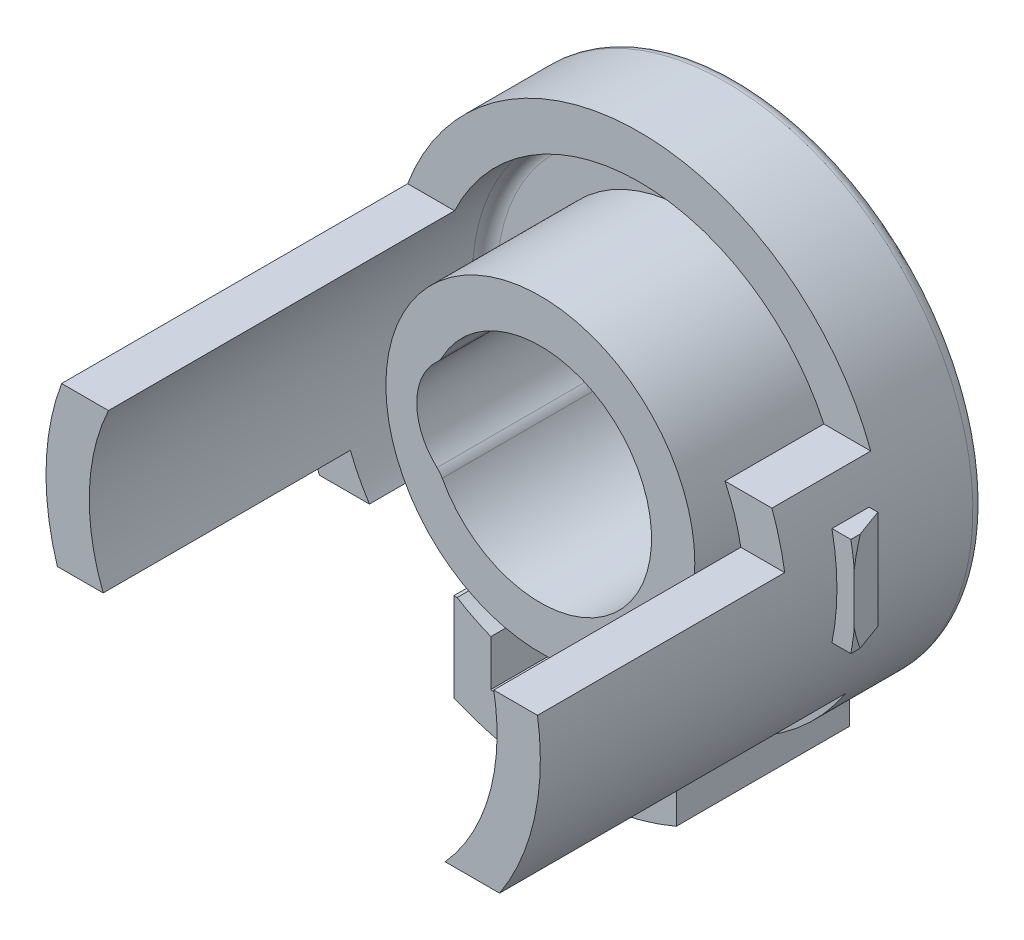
ISO-10303-21;
HEADER;
FILE_DESCRIPTION(('STEP AP214'),'2;1');
FILE_NAME('part.step','',(''),(''),'','','');
FILE_SCHEMA(('AUTOMOTIVE_DESIGN { 1 0 10303 214 1 1 1 1 }'));
ENDSEC;
DATA;
#1=APPLICATION_CONTEXT('core data for automotive mechanical design processes');
#2=APPLICATION_PROTOCOL_DEFINITION('international standard','automotive_design',2000,#1);
#3=PRODUCT_CONTEXT('',#1,'mechanical');
#4=PRODUCT('Part','Part','',(#3));
#5=PRODUCT_RELATED_PRODUCT_CATEGORY('part','',(#4));
#6=PRODUCT_DEFINITION_FORMATION('','',#4);
#7=PRODUCT_DEFINITION_CONTEXT('part definition',#1,'design');
#8=PRODUCT_DEFINITION('design','',#6,#7);
#9=PRODUCT_DEFINITION_SHAPE('','',#8);
#10=(LENGTH_UNIT() NAMED_UNIT(*) SI_UNIT(.MILLI.,.METRE.));
#11=(NAMED_UNIT(*) PLANE_ANGLE_UNIT() SI_UNIT($,.RADIAN.));
#12=(NAMED_UNIT(*) SI_UNIT($,.STERADIAN.) SOLID_ANGLE_UNIT());
#13=UNCERTAINTY_MEASURE_WITH_UNIT(LENGTH_MEASURE(1.E-05),#10,'distance_accuracy_value','');
#14=(GEOMETRIC_REPRESENTATION_CONTEXT(3) GLOBAL_UNCERTAINTY_ASSIGNED_CONTEXT((#13)) GLOBAL_UNIT_ASSIGNED_CONTEXT((#10,
#11,#12)) REPRESENTATION_CONTEXT('',''));
#15=CARTESIAN_POINT('',(0.,0.,0.));
#16=DIRECTION('',(0.,0.,1.));
#17=DIRECTION('',(1.,0.,0.));
#18=AXIS2_PLACEMENT_3D('',#15,#16,#17);
#19=CARTESIAN_POINT('',(0.,0.,18.));
#20=DIRECTION('',(0.,0.,-1.));
#21=DIRECTION('',(-1.,0.,0.));
#22=AXIS2_PLACEMENT_3D('',#19,#20,#21);
#23=CYLINDRICAL_SURFACE('',#22,10.);
#24=DIRECTION('',(0.,0.,-1.));
#25=VECTOR('',#24,1.);
#26=CARTESIAN_POINT('',(9.79795897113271,2.,18.));
#27=LINE('',#26,#25);
#28=CARTESIAN_POINT('',(9.79795897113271,2.,4.5000000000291));
#29=VERTEX_POINT('',#28);
#30=CARTESIAN_POINT('',(9.79795897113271,2.,6.0000000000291));
#31=VERTEX_POINT('',#30);
#32=EDGE_CURVE('E902',#29,#31,#27,.F.);
#33=ORIENTED_EDGE('',*,*,#32,.F.);
#34=CARTESIAN_POINT('',(0.,0.,4.5000000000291));
#35=DIRECTION('',(0.,0.,1.));
#36=DIRECTION('',(1.,0.,0.));
#37=AXIS2_PLACEMENT_3D('',#34,#35,#36);
#38=CIRCLE('',#37,10.);
#39=CARTESIAN_POINT('',(9.79795897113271,-2.,4.5000000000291));
#40=VERTEX_POINT('',#39);
#41=EDGE_CURVE('E926',#40,#29,#38,.T.);
#42=ORIENTED_EDGE('',*,*,#41,.F.);
#43=DIRECTION('',(0.,0.,-1.));
#44=VECTOR('',#43,1.);
#45=CARTESIAN_POINT('',(9.79795897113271,-2.,18.));
#46=LINE('',#45,#44);
#47=CARTESIAN_POINT('',(9.79795897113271,-2.,6.0000000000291));
#48=VERTEX_POINT('',#47);
#49=EDGE_CURVE('E931',#40,#48,#46,.F.);
#50=ORIENTED_EDGE('',*,*,#49,.T.);
#51=CARTESIAN_POINT('',(0.,0.,6.0000000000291));
#52=DIRECTION('',(0.,0.,-1.));
#53=DIRECTION('',(-1.,0.,0.));
#54=AXIS2_PLACEMENT_3D('',#51,#52,#53);
#55=CIRCLE('',#54,10.);
#56=EDGE_CURVE('E928',#31,#48,#55,.T.);
#57=ORIENTED_EDGE('',*,*,#56,.F.);
#58=EDGE_LOOP('',(#33,#42,#50,#57));
#59=FACE_BOUND('',#58,.T.);
#60=DIRECTION('',(0.,0.,-1.));
#61=VECTOR('',#60,1.);
#62=CARTESIAN_POINT('',(4.5,-8.93028554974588,18.));
#63=LINE('',#62,#61);
#64=CARTESIAN_POINT('',(4.5,-8.93028554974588,4.0000000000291));
#65=VERTEX_POINT('',#64);
#66=CARTESIAN_POINT('',(4.5,-8.93028554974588,0.5));
#67=VERTEX_POINT('',#66);
#68=EDGE_CURVE('E560',#65,#67,#63,.T.);
#69=ORIENTED_EDGE('',*,*,#68,.T.);
#70=CARTESIAN_POINT('',(0.,0.,0.5));
#71=DIRECTION('',(0.,0.,1.));
#72=DIRECTION('',(1.,0.,0.));
#73=AXIS2_PLACEMENT_3D('',#70,#71,#72);
#74=CIRCLE('',#73,10.);
#75=CARTESIAN_POINT('',(-4.5,-8.93028554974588,0.5));
#76=VERTEX_POINT('',#75);
#77=EDGE_CURVE('E750',#67,#76,#74,.T.);
#78=ORIENTED_EDGE('',*,*,#77,.T.);
#79=DIRECTION('',(0.,0.,-1.));
#80=VECTOR('',#79,1.);
#81=CARTESIAN_POINT('',(-4.5,-8.93028554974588,18.));
#82=LINE('',#81,#80);
#83=CARTESIAN_POINT('',(-4.5,-8.93028554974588,4.0000000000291));
#84=VERTEX_POINT('',#83);
#85=EDGE_CURVE('E589',#76,#84,#82,.F.);
#86=ORIENTED_EDGE('',*,*,#85,.T.);
#87=CARTESIAN_POINT('',(0.,0.,4.0000000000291));
#88=DIRECTION('',(0.,0.,1.));
#89=DIRECTION('',(1.,0.,0.));
#90=AXIS2_PLACEMENT_3D('',#87,#88,#89);
#91=CIRCLE('',#90,10.);
#92=CARTESIAN_POINT('',(-8.93028554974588,-4.49999999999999,4.0000000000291));
#93=VERTEX_POINT('',#92);
#94=EDGE_CURVE('E658',#93,#84,#91,.T.);
#95=ORIENTED_EDGE('',*,*,#94,.F.);
#96=DIRECTION('',(0.,0.,1.));
#97=VECTOR('',#96,1.);
#98=CARTESIAN_POINT('',(-8.93028554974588,-4.49999999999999,4.0000000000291));
#99=LINE('',#98,#97);
#100=CARTESIAN_POINT('',(-8.93028554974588,-4.49999999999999,7.99999999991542));
#101=VERTEX_POINT('',#100);
#102=EDGE_CURVE('E642',#93,#101,#99,.T.);
#103=ORIENTED_EDGE('',*,*,#102,.T.);
#104=CARTESIAN_POINT('',(0.,0.,7.99999999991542));
#105=DIRECTION('',(0.,0.,1.));
#106=DIRECTION('',(1.,0.,0.));
#107=AXIS2_PLACEMENT_3D('',#104,#105,#106);
#108=CIRCLE('',#107,10.);
#109=CARTESIAN_POINT('',(-9.53939201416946,-3.,7.99999999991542));
#110=VERTEX_POINT('',#109);
#111=EDGE_CURVE('E609',#110,#101,#108,.T.);
#112=ORIENTED_EDGE('',*,*,#111,.F.);
#113=DIRECTION('',(0.,0.,-1.));
#114=VECTOR('',#113,1.);
#115=CARTESIAN_POINT('',(-9.53939201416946,-3.,18.));
#116=LINE('',#115,#114);
#117=CARTESIAN_POINT('',(-9.53939201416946,-3.,17.9999999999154));
#118=VERTEX_POINT('',#117);
#119=EDGE_CURVE('E614',#118,#110,#116,.T.);
#120=ORIENTED_EDGE('',*,*,#119,.F.);
#121=CARTESIAN_POINT('',(0.,0.,18.));
#122=DIRECTION('',(0.,0.,1.));
#123=DIRECTION('',(1.,0.,0.));
#124=AXIS2_PLACEMENT_3D('',#121,#122,#123);
#125=CIRCLE('',#124,10.);
#126=CARTESIAN_POINT('',(-9.3674969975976,3.5,18.0000000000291));
#127=VERTEX_POINT('',#126);
#128=EDGE_CURVE('E697',#127,#118,#125,.T.);
#129=ORIENTED_EDGE('',*,*,#128,.F.);
#130=DIRECTION('',(0.,0.,-1.));
#131=VECTOR('',#130,1.);
#132=CARTESIAN_POINT('',(-9.3674969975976,3.5,18.));
#133=LINE('',#132,#131);
#134=CARTESIAN_POINT('',(-9.3674969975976,3.5,4.0000000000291));
#135=VERTEX_POINT('',#134);
#136=EDGE_CURVE('E655',#135,#127,#133,.F.);
#137=ORIENTED_EDGE('',*,*,#136,.F.);
#138=CARTESIAN_POINT('',(9.3674969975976,3.5,4.0000000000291));
#139=VERTEX_POINT('',#138);
#140=EDGE_CURVE('E661',#139,#135,#91,.T.);
#141=ORIENTED_EDGE('',*,*,#140,.F.);
#142=DIRECTION('',(0.,0.,1.));
#143=VECTOR('',#142,1.);
#144=CARTESIAN_POINT('',(9.3674969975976,3.5,4.0000000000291));
#145=LINE('',#144,#143);
#146=CARTESIAN_POINT('',(9.3674969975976,3.5,7.99999999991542));
#147=VERTEX_POINT('',#146);
#148=EDGE_CURVE('E637',#139,#147,#145,.T.);
#149=ORIENTED_EDGE('',*,*,#148,.T.);
#150=CARTESIAN_POINT('',(9.88685996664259,1.5,7.99999999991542));
#151=VERTEX_POINT('',#150);
#152=EDGE_CURVE('E605',#151,#147,#108,.T.);
#153=ORIENTED_EDGE('',*,*,#152,.F.);
#154=DIRECTION('',(0.,0.,-1.));
#155=VECTOR('',#154,1.);
#156=CARTESIAN_POINT('',(9.88685996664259,1.5,18.));
#157=LINE('',#156,#155);
#158=CARTESIAN_POINT('',(9.88685996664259,1.5,17.9999999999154));
#159=VERTEX_POINT('',#158);
#160=EDGE_CURVE('E618',#159,#151,#157,.T.);
#161=ORIENTED_EDGE('',*,*,#160,.F.);
#162=CARTESIAN_POINT('',(8.35164654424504,-5.5,18.0000000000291));
#163=VERTEX_POINT('',#162);
#164=EDGE_CURVE('E698',#163,#159,#125,.T.);
#165=ORIENTED_EDGE('',*,*,#164,.F.);
#166=DIRECTION('',(0.,0.,-1.));
#167=VECTOR('',#166,1.);
#168=CARTESIAN_POINT('',(8.35164654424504,-5.5,18.));
#169=LINE('',#168,#167);
#170=CARTESIAN_POINT('',(8.35164654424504,-5.5,4.0000000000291));
#171=VERTEX_POINT('',#170);
#172=EDGE_CURVE('E651',#171,#163,#169,.F.);
#173=ORIENTED_EDGE('',*,*,#172,.F.);
#174=EDGE_CURVE('E657',#65,#171,#91,.T.);
#175=ORIENTED_EDGE('',*,*,#174,.F.);
#176=EDGE_LOOP('',(#69,#78,#86,#95,#103,#112,#120,#129,#137,#141,#149,#153,#161,#165,#173,#175));
#177=FACE_BOUND('',#176,.T.);
#178=DIRECTION('',(0.,0.,-1.));
#179=VECTOR('',#178,1.);
#180=CARTESIAN_POINT('',(-9.79795897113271,2.,18.));
#181=LINE('',#180,#179);
#182=CARTESIAN_POINT('',(-9.79795897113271,2.,6.0000000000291));
#183=VERTEX_POINT('',#182);
#184=CARTESIAN_POINT('',(-9.79795897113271,2.,4.5000000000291));
#185=VERTEX_POINT('',#184);
#186=EDGE_CURVE('E383',#183,#185,#181,.T.);
#187=ORIENTED_EDGE('',*,*,#186,.F.);
#188=CARTESIAN_POINT('',(0.,0.,6.0000000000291));
#189=DIRECTION('',(0.,0.,1.));
#190=DIRECTION('',(1.,0.,0.));
#191=AXIS2_PLACEMENT_3D('',#188,#189,#190);
#192=CIRCLE('',#191,10.);
#193=CARTESIAN_POINT('',(-9.79795897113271,-2.,6.0000000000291));
#194=VERTEX_POINT('',#193);
#195=EDGE_CURVE('E911',#183,#194,#192,.T.);
#196=ORIENTED_EDGE('',*,*,#195,.T.);
#197=DIRECTION('',(0.,0.,-1.));
#198=VECTOR('',#197,1.);
#199=CARTESIAN_POINT('',(-9.79795897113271,-2.,18.));
#200=LINE('',#199,#198);
#201=CARTESIAN_POINT('',(-9.79795897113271,-2.,4.5000000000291));
#202=VERTEX_POINT('',#201);
#203=EDGE_CURVE('E920',#194,#202,#200,.T.);
#204=ORIENTED_EDGE('',*,*,#203,.T.);
#205=CARTESIAN_POINT('',(0.,0.,4.5000000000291));
#206=DIRECTION('',(0.,0.,-1.));
#207=DIRECTION('',(-1.,0.,0.));
#208=AXIS2_PLACEMENT_3D('',#205,#206,#207);
#209=CIRCLE('',#208,10.);
#210=EDGE_CURVE('E913',#202,#185,#209,.T.);
#211=ORIENTED_EDGE('',*,*,#210,.T.);
#212=EDGE_LOOP('',(#187,#196,#204,#211));
#213=FACE_BOUND('',#212,.T.);
#214=ADVANCED_FACE('F29',(#59,#177,#213),#23,.T.);
#215=CARTESIAN_POINT('',(8.37077639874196,2.,6.0000000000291));
#216=DIRECTION('',(0.,0.,-1.));
#217=DIRECTION('',(-1.,0.,0.));
#218=AXIS2_PLACEMENT_3D('',#215,#216,#217);
#219=PLANE('',#218);
#220=CARTESIAN_POINT('',(0.,0.,6.0000000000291));
#221=DIRECTION('',(0.,0.,-1.));
#222=DIRECTION('',(-1.,0.,0.));
#223=AXIS2_PLACEMENT_3D('',#220,#221,#222);
#224=CIRCLE('',#223,10.75);
#225=CARTESIAN_POINT('',(10.5623150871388,2.,6.0000000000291));
#226=VERTEX_POINT('',#225);
#227=CARTESIAN_POINT('',(10.7,1.03561575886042,6.0000000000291));
#228=VERTEX_POINT('',#227);
#229=EDGE_CURVE('E409',#226,#228,#224,.T.);
#230=ORIENTED_EDGE('',*,*,#229,.F.);
#231=DIRECTION('',(1.,0.,0.));
#232=VECTOR('',#231,1.);
#233=CARTESIAN_POINT('',(8.37077639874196,2.,6.0000000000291));
#234=LINE('',#233,#232);
#235=EDGE_CURVE('E422',#31,#226,#234,.T.);
#236=ORIENTED_EDGE('',*,*,#235,.F.);
#237=ORIENTED_EDGE('',*,*,#56,.T.);
#238=DIRECTION('',(1.,0.,0.));
#239=VECTOR('',#238,1.);
#240=CARTESIAN_POINT('',(8.37077639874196,-2.,6.0000000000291));
#241=LINE('',#240,#239);
#242=CARTESIAN_POINT('',(10.5623150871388,-2.,6.0000000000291));
#243=VERTEX_POINT('',#242);
#244=EDGE_CURVE('E414',#48,#243,#241,.T.);
#245=ORIENTED_EDGE('',*,*,#244,.T.);
#246=CARTESIAN_POINT('',(10.7,-1.03561575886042,6.0000000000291));
#247=VERTEX_POINT('',#246);
#248=EDGE_CURVE('E406',#247,#243,#224,.T.);
#249=ORIENTED_EDGE('',*,*,#248,.F.);
#250=DIRECTION('',(0.,-1.,0.));
#251=VECTOR('',#250,1.);
#252=CARTESIAN_POINT('',(10.7,2.,6.0000000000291));
#253=LINE('',#252,#251);
#254=EDGE_CURVE('E430',#228,#247,#253,.T.);
#255=ORIENTED_EDGE('',*,*,#254,.F.);
#256=EDGE_LOOP('',(#230,#236,#237,#245,#249,#255));
#257=FACE_BOUND('',#256,.T.);
#258=ADVANCED_FACE('F890',(#257),#219,.F.);
#259=CARTESIAN_POINT('',(8.37077639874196,2.,4.5000000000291));
#260=DIRECTION('',(0.,-1.,0.));
#261=DIRECTION('',(0.,0.,-1.));
#262=AXIS2_PLACEMENT_3D('',#259,#260,#261);
#263=PLANE('',#262);
#264=DIRECTION('',(0.,0.,1.));
#265=VECTOR('',#264,1.);
#266=CARTESIAN_POINT('',(10.5623150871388,2.,-0.0393596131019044));
#267=LINE('',#266,#265);
#268=CARTESIAN_POINT('',(10.5623150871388,2.,5.62171381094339));
#269=VERTEX_POINT('',#268);
#270=EDGE_CURVE('E408',#269,#226,#267,.T.);
#271=ORIENTED_EDGE('',*,*,#270,.F.);
#272=DIRECTION('',(-0.342020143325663,0.,-0.939692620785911));
#273=VECTOR('',#272,1.);
#274=CARTESIAN_POINT('',(10.1540446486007,2.,4.5000000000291));
#275=LINE('',#274,#273);
#276=CARTESIAN_POINT('',(10.1540446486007,2.,4.5000000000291));
#277=VERTEX_POINT('',#276);
#278=EDGE_CURVE('E425',#269,#277,#275,.T.);
#279=ORIENTED_EDGE('',*,*,#278,.T.);
#280=DIRECTION('',(-1.,0.,0.));
#281=VECTOR('',#280,1.);
#282=CARTESIAN_POINT('',(8.37077639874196,2.,4.5000000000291));
#283=LINE('',#282,#281);
#284=EDGE_CURVE('E419',#277,#29,#283,.T.);
#285=ORIENTED_EDGE('',*,*,#284,.T.);
#286=ORIENTED_EDGE('',*,*,#32,.T.);
#287=ORIENTED_EDGE('',*,*,#235,.T.);
#288=EDGE_LOOP('',(#271,#279,#285,#286,#287));
#289=FACE_BOUND('',#288,.T.);
#290=ADVANCED_FACE('F895',(#289),#263,.F.);
#291=CARTESIAN_POINT('',(8.37077639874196,-2.,4.5000000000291));
#292=DIRECTION('',(0.,-1.,0.));
#293=DIRECTION('',(0.,0.,-1.));
#294=AXIS2_PLACEMENT_3D('',#291,#292,#293);
#295=PLANE('',#294);
#296=DIRECTION('',(-0.342020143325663,0.,-0.939692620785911));
#297=VECTOR('',#296,1.);
#298=CARTESIAN_POINT('',(10.1540446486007,-2.,4.5000000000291));
#299=LINE('',#298,#297);
#300=CARTESIAN_POINT('',(10.5623150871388,-2.,5.62171381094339));
#301=VERTEX_POINT('',#300);
#302=CARTESIAN_POINT('',(10.1540446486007,-2.,4.5000000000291));
#303=VERTEX_POINT('',#302);
#304=EDGE_CURVE('E417',#301,#303,#299,.T.);
#305=ORIENTED_EDGE('',*,*,#304,.F.);
#306=DIRECTION('',(0.,0.,1.));
#307=VECTOR('',#306,1.);
#308=CARTESIAN_POINT('',(10.5623150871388,-2.,-0.0393596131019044));
#309=LINE('',#308,#307);
#310=EDGE_CURVE('E398',#301,#243,#309,.T.);
#311=ORIENTED_EDGE('',*,*,#310,.T.);
#312=ORIENTED_EDGE('',*,*,#244,.F.);
#313=ORIENTED_EDGE('',*,*,#49,.F.);
#314=DIRECTION('',(-1.,0.,0.));
#315=VECTOR('',#314,1.);
#316=CARTESIAN_POINT('',(8.37077639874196,-2.,4.5000000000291));
#317=LINE('',#316,#315);
#318=EDGE_CURVE('E411',#303,#40,#317,.T.);
#319=ORIENTED_EDGE('',*,*,#318,.F.);
#320=EDGE_LOOP('',(#305,#311,#312,#313,#319));
#321=FACE_BOUND('',#320,.T.);
#322=ADVANCED_FACE('F1124',(#321),#295,.T.);
#323=CARTESIAN_POINT('',(10.1540446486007,2.,4.5000000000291));
#324=DIRECTION('',(-0.939692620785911,0.,0.342020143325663));
#325=DIRECTION('',(0.342020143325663,0.,0.939692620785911));
#326=AXIS2_PLACEMENT_3D('',#323,#324,#325);
#327=PLANE('',#326);
#328=CARTESIAN_POINT('',(0.,0.,-23.3980083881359));
#329=DIRECTION('',(-0.939692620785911,0.,0.342020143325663));
#330=DIRECTION('',(0.342020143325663,0.,0.939692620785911));
#331=AXIS2_PLACEMENT_3D('',#328,#329,#330);
#332=ELLIPSE('',#331,31.4308973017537,10.75);
#333=EDGE_CURVE('E922',#228,#269,#332,.T.);
#334=ORIENTED_EDGE('',*,*,#333,.F.);
#335=ORIENTED_EDGE('',*,*,#254,.T.);
#336=EDGE_CURVE('E923',#301,#247,#332,.T.);
#337=ORIENTED_EDGE('',*,*,#336,.F.);
#338=ORIENTED_EDGE('',*,*,#304,.T.);
#339=DIRECTION('',(0.,-1.,0.));
#340=VECTOR('',#339,1.);
#341=CARTESIAN_POINT('',(10.1540446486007,2.,4.5000000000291));
#342=LINE('',#341,#340);
#343=EDGE_CURVE('E427',#277,#303,#342,.T.);
#344=ORIENTED_EDGE('',*,*,#343,.F.);
#345=ORIENTED_EDGE('',*,*,#278,.F.);
#346=EDGE_LOOP('',(#334,#335,#337,#338,#344,#345));
#347=FACE_BOUND('',#346,.T.);
#348=ADVANCED_FACE('F877',(#347),#327,.F.);
#349=CARTESIAN_POINT('',(0.,0.,0.));
#350=DIRECTION('',(0.,0.,1.));
#351=DIRECTION('',(1.,0.,0.));
#352=AXIS2_PLACEMENT_3D('',#349,#350,#351);
#353=PLANE('',#352);
#354=DIRECTION('',(0.,1.,0.));
#355=VECTOR('',#354,1.);
#356=CARTESIAN_POINT('',(-4.5,-7.,0.));
#357=LINE('',#356,#355);
#358=CARTESIAN_POINT('',(-4.5,-10.5830052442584,0.));
#359=VERTEX_POINT('',#358);
#360=CARTESIAN_POINT('',(-4.5,-8.36660026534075,0.));
#361=VERTEX_POINT('',#360);
#362=EDGE_CURVE('E525',#359,#361,#357,.T.);
#363=ORIENTED_EDGE('',*,*,#362,.T.);
#364=CARTESIAN_POINT('',(0.,0.,0.));
#365=DIRECTION('',(0.,0.,1.));
#366=DIRECTION('',(1.,0.,0.));
#367=AXIS2_PLACEMENT_3D('',#364,#365,#366);
#368=CIRCLE('',#367,9.5);
#369=CARTESIAN_POINT('',(4.5,-8.36660026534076,0.));
#370=VERTEX_POINT('',#369);
#371=EDGE_CURVE('E753',#361,#370,#368,.F.);
#372=ORIENTED_EDGE('',*,*,#371,.T.);
#373=DIRECTION('',(0.,-1.,0.));
#374=VECTOR('',#373,1.);
#375=CARTESIAN_POINT('',(4.5,-7.,0.));
#376=LINE('',#375,#374);
#377=CARTESIAN_POINT('',(4.5,-10.5830052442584,0.));
#378=VERTEX_POINT('',#377);
#379=EDGE_CURVE('E519',#370,#378,#376,.T.);
#380=ORIENTED_EDGE('',*,*,#379,.T.);
#381=CARTESIAN_POINT('',(0.,0.,0.));
#382=DIRECTION('',(0.,0.,-1.));
#383=DIRECTION('',(-1.,0.,0.));
#384=AXIS2_PLACEMENT_3D('',#381,#382,#383);
#385=CIRCLE('',#384,11.5);
#386=CARTESIAN_POINT('',(3.,-11.1018016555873,0.));
#387=VERTEX_POINT('',#386);
#388=EDGE_CURVE('E522',#378,#387,#385,.T.);
#389=ORIENTED_EDGE('',*,*,#388,.T.);
#390=DIRECTION('',(0.,1.,0.));
#391=VECTOR('',#390,1.);
#392=CARTESIAN_POINT('',(3.,-8.5,0.));
#393=LINE('',#392,#391);
#394=CARTESIAN_POINT('',(3.,-8.5,0.));
#395=VERTEX_POINT('',#394);
#396=EDGE_CURVE('E506',#387,#395,#393,.T.);
#397=ORIENTED_EDGE('',*,*,#396,.T.);
#398=DIRECTION('',(-1.,0.,0.));
#399=VECTOR('',#398,1.);
#400=CARTESIAN_POINT('',(-3.,-8.5,0.));
#401=LINE('',#400,#399);
#402=CARTESIAN_POINT('',(-3.,-8.5,0.));
#403=VERTEX_POINT('',#402);
#404=EDGE_CURVE('E509',#395,#403,#401,.T.);
#405=ORIENTED_EDGE('',*,*,#404,.T.);
#406=DIRECTION('',(0.,-1.,0.));
#407=VECTOR('',#406,1.);
#408=CARTESIAN_POINT('',(-3.,-8.5,0.));
#409=LINE('',#408,#407);
#410=CARTESIAN_POINT('',(-3.,-11.1018016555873,0.));
#411=VERTEX_POINT('',#410);
#412=EDGE_CURVE('E504',#403,#411,#409,.T.);
#413=ORIENTED_EDGE('',*,*,#412,.T.);
#414=EDGE_CURVE('E521',#411,#359,#385,.T.);
#415=ORIENTED_EDGE('',*,*,#414,.T.);
#416=EDGE_LOOP('',(#363,#372,#380,#389,#397,#405,#413,#415));
#417=FACE_BOUND('',#416,.T.);
#418=DIRECTION('',(0.,-1.,0.));
#419=VECTOR('',#418,1.);
#420=CARTESIAN_POINT('',(-1.5,7.25,0.));
#421=LINE('',#420,#419);
#422=CARTESIAN_POINT('',(-1.5,7.85811682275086,0.));
#423=VERTEX_POINT('',#422);
#424=CARTESIAN_POINT('',(-1.5,7.34846922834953,0.));
#425=VERTEX_POINT('',#424);
#426=EDGE_CURVE('E436',#423,#425,#421,.T.);
#427=ORIENTED_EDGE('',*,*,#426,.T.);
#428=CARTESIAN_POINT('',(0.,0.,0.));
#429=DIRECTION('',(0.,0.,-1.));
#430=DIRECTION('',(-1.,0.,0.));
#431=AXIS2_PLACEMENT_3D('',#428,#429,#430);
#432=CIRCLE('',#431,7.5);
#433=CARTESIAN_POINT('',(1.5,7.34846922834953,0.));
#434=VERTEX_POINT('',#433);
#435=EDGE_CURVE('E682',#434,#425,#432,.T.);
#436=ORIENTED_EDGE('',*,*,#435,.F.);
#437=DIRECTION('',(0.,1.,0.));
#438=VECTOR('',#437,1.);
#439=CARTESIAN_POINT('',(1.5,7.25,0.));
#440=LINE('',#439,#438);
#441=CARTESIAN_POINT('',(1.5,7.85811682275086,0.));
#442=VERTEX_POINT('',#441);
#443=EDGE_CURVE('E439',#434,#442,#440,.T.);
#444=ORIENTED_EDGE('',*,*,#443,.T.);
#445=CARTESIAN_POINT('',(0.,0.,0.));
#446=DIRECTION('',(0.,0.,1.));
#447=DIRECTION('',(1.,0.,0.));
#448=AXIS2_PLACEMENT_3D('',#445,#446,#447);
#449=CIRCLE('',#448,8.);
#450=EDGE_CURVE('E433',#442,#423,#449,.T.);
#451=ORIENTED_EDGE('',*,*,#450,.T.);
#452=EDGE_LOOP('',(#427,#436,#444,#451));
#453=FACE_BOUND('',#452,.T.);
#454=ADVANCED_FACE('F860',(#417,#453),#353,.F.);
#455=CARTESIAN_POINT('',(0.,0.,0.5));
#456=DIRECTION('',(0.,0.,-1.));
#457=DIRECTION('',(-1.,0.,0.));
#458=AXIS2_PLACEMENT_3D('',#455,#456,#457);
#459=CYLINDRICAL_SURFACE('',#458,7.5);
#460=DIRECTION('',(0.,0.,-1.));
#461=VECTOR('',#460,1.);
#462=CARTESIAN_POINT('',(-1.5,7.34846922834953,0.5));
#463=LINE('',#462,#461);
#464=CARTESIAN_POINT('',(-1.5,7.34846922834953,0.5));
#465=VERTEX_POINT('',#464);
#466=EDGE_CURVE('E463',#465,#425,#463,.T.);
#467=ORIENTED_EDGE('',*,*,#466,.F.);
#468=CARTESIAN_POINT('',(0.,0.,0.5));
#469=DIRECTION('',(0.,0.,-1.));
#470=DIRECTION('',(-1.,0.,0.));
#471=AXIS2_PLACEMENT_3D('',#468,#469,#470);
#472=CIRCLE('',#471,7.5);
#473=CARTESIAN_POINT('',(1.5,7.34846922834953,0.5));
#474=VERTEX_POINT('',#473);
#475=EDGE_CURVE('E685',#474,#465,#472,.T.);
#476=ORIENTED_EDGE('',*,*,#475,.F.);
#477=DIRECTION('',(0.,0.,-1.));
#478=VECTOR('',#477,1.);
#479=CARTESIAN_POINT('',(1.5,7.34846922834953,0.5));
#480=LINE('',#479,#478);
#481=EDGE_CURVE('E455',#434,#474,#480,.F.);
#482=ORIENTED_EDGE('',*,*,#481,.F.);
#483=ORIENTED_EDGE('',*,*,#435,.T.);
#484=EDGE_LOOP('',(#467,#476,#482,#483));
#485=FACE_BOUND('',#484,.T.);
#486=ADVANCED_FACE('F856',(#485),#459,.F.);
#487=CARTESIAN_POINT('',(0.,0.,0.5));
#488=DIRECTION('',(0.,0.,-1.));
#489=DIRECTION('',(-1.,0.,0.));
#490=AXIS2_PLACEMENT_3D('',#487,#488,#489);
#491=PLANE('',#490);
#492=CARTESIAN_POINT('',(0.,0.,0.5));
#493=DIRECTION('',(0.,0.,-1.));
#494=DIRECTION('',(-1.,0.,0.));
#495=AXIS2_PLACEMENT_3D('',#492,#493,#494);
#496=CIRCLE('',#495,4.5);
#497=CARTESIAN_POINT('',(-3.96818181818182,2.12215292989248,0.5));
#498=VERTEX_POINT('',#497);
#499=CARTESIAN_POINT('',(-3.96818181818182,-2.12215292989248,0.5));
#500=VERTEX_POINT('',#499);
#501=EDGE_CURVE('E688',#498,#500,#496,.T.);
#502=ORIENTED_EDGE('',*,*,#501,.F.);
#503=CARTESIAN_POINT('',(-4.85,2.59374246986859,0.5));
#504=DIRECTION('',(0.,0.,-1.));
#505=DIRECTION('',(-1.,0.,0.));
#506=AXIS2_PLACEMENT_3D('',#503,#504,#505);
#507=CIRCLE('',#506,1.);
#508=CARTESIAN_POINT('',(-4.17857142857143,1.85267319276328,0.5));
#509=VERTEX_POINT('',#508);
#510=EDGE_CURVE('E710',#509,#498,#507,.F.);
#511=ORIENTED_EDGE('',*,*,#510,.F.);
#512=CARTESIAN_POINT('',(-2.5,0.,0.5));
#513=DIRECTION('',(0.,0.,-1.));
#514=DIRECTION('',(-1.,0.,0.));
#515=AXIS2_PLACEMENT_3D('',#512,#513,#514);
#516=CIRCLE('',#515,2.5);
#517=CARTESIAN_POINT('',(-4.17857142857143,-1.85267319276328,0.5));
#518=VERTEX_POINT('',#517);
#519=EDGE_CURVE('E691',#518,#509,#516,.T.);
#520=ORIENTED_EDGE('',*,*,#519,.F.);
#521=CARTESIAN_POINT('',(-4.85,-2.59374246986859,0.5));
#522=DIRECTION('',(0.,0.,-1.));
#523=DIRECTION('',(-1.,0.,0.));
#524=AXIS2_PLACEMENT_3D('',#521,#522,#523);
#525=CIRCLE('',#524,1.);
#526=EDGE_CURVE('E694',#500,#518,#525,.F.);
#527=ORIENTED_EDGE('',*,*,#526,.F.);
#528=EDGE_LOOP('',(#502,#511,#520,#527));
#529=FACE_BOUND('',#528,.T.);
#530=ORIENTED_EDGE('',*,*,#475,.T.);
#531=DIRECTION('',(0.,-1.,0.));
#532=VECTOR('',#531,1.);
#533=CARTESIAN_POINT('',(-1.5,0.,0.5));
#534=LINE('',#533,#532);
#535=CARTESIAN_POINT('',(-1.5,7.25,0.5));
#536=VERTEX_POINT('',#535);
#537=EDGE_CURVE('E460',#465,#536,#534,.T.);
#538=ORIENTED_EDGE('',*,*,#537,.T.);
#539=DIRECTION('',(1.,0.,0.));
#540=VECTOR('',#539,1.);
#541=CARTESIAN_POINT('',(0.,7.25,0.5));
#542=LINE('',#541,#540);
#543=CARTESIAN_POINT('',(1.5,7.25,0.5));
#544=VERTEX_POINT('',#543);
#545=EDGE_CURVE('E457',#536,#544,#542,.T.);
#546=ORIENTED_EDGE('',*,*,#545,.T.);
#547=DIRECTION('',(0.,1.,0.));
#548=VECTOR('',#547,1.);
#549=CARTESIAN_POINT('',(1.5,0.,0.5));
#550=LINE('',#549,#548);
#551=EDGE_CURVE('E452',#544,#474,#550,.T.);
#552=ORIENTED_EDGE('',*,*,#551,.T.);
#553=EDGE_LOOP('',(#530,#538,#546,#552));
#554=FACE_BOUND('',#553,.T.);
#555=ADVANCED_FACE('F848',(#529,#554),#491,.T.);
#556=CARTESIAN_POINT('',(0.,0.,2.));
#557=DIRECTION('',(0.,0.,1.));
#558=DIRECTION('',(1.,0.,0.));
#559=AXIS2_PLACEMENT_3D('',#556,#557,#558);
#560=PLANE('',#559);
#561=CARTESIAN_POINT('',(0.,0.,2.));
#562=DIRECTION('',(0.,0.,1.));
#563=DIRECTION('',(1.,0.,0.));
#564=AXIS2_PLACEMENT_3D('',#561,#562,#563);
#565=CIRCLE('',#564,6.25);
#566=CARTESIAN_POINT('',(6.25,0.,2.));
#567=VERTEX_POINT('',#566);
#568=EDGE_CURVE('E675',#567,#567,#565,.T.);
#569=ORIENTED_EDGE('',*,*,#568,.F.);
#570=EDGE_LOOP('',(#569));
#571=FACE_BOUND('',#570,.T.);
#572=DIRECTION('',(0.,1.,0.));
#573=VECTOR('',#572,1.);
#574=CARTESIAN_POINT('',(-1.5,0.,2.));
#575=LINE('',#574,#573);
#576=CARTESIAN_POINT('',(-1.5,7.25,2.));
#577=VERTEX_POINT('',#576);
#578=CARTESIAN_POINT('',(-1.5,7.60345316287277,2.));
#579=VERTEX_POINT('',#578);
#580=EDGE_CURVE('E747',#577,#579,#575,.T.);
#581=ORIENTED_EDGE('',*,*,#580,.T.);
#582=CARTESIAN_POINT('',(0.,0.,2.));
#583=DIRECTION('',(0.,0.,1.));
#584=DIRECTION('',(1.,0.,0.));
#585=AXIS2_PLACEMENT_3D('',#582,#583,#584);
#586=CIRCLE('',#585,7.75);
#587=CARTESIAN_POINT('',(1.5,7.60345316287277,2.));
#588=VERTEX_POINT('',#587);
#589=EDGE_CURVE('E1067',#579,#588,#586,.T.);
#590=ORIENTED_EDGE('',*,*,#589,.T.);
#591=DIRECTION('',(0.,-1.,0.));
#592=VECTOR('',#591,1.);
#593=CARTESIAN_POINT('',(1.5,0.,2.));
#594=LINE('',#593,#592);
#595=CARTESIAN_POINT('',(1.5,7.25,2.));
#596=VERTEX_POINT('',#595);
#597=EDGE_CURVE('E742',#588,#596,#594,.T.);
#598=ORIENTED_EDGE('',*,*,#597,.T.);
#599=DIRECTION('',(-1.,0.,0.));
#600=VECTOR('',#599,1.);
#601=CARTESIAN_POINT('',(0.,7.25,2.));
#602=LINE('',#601,#600);
#603=EDGE_CURVE('E744',#596,#577,#602,.T.);
#604=ORIENTED_EDGE('',*,*,#603,.T.);
#605=EDGE_LOOP('',(#581,#590,#598,#604));
#606=FACE_BOUND('',#605,.T.);
#607=ADVANCED_FACE('F844',(#571,#606),#560,.T.);
#608=CARTESIAN_POINT('',(0.,0.,7.));
#609=DIRECTION('',(0.,0.,-1.));
#610=DIRECTION('',(-1.,0.,0.));
#611=AXIS2_PLACEMENT_3D('',#608,#609,#610);
#612=CYLINDRICAL_SURFACE('',#611,10.);
#613=DIRECTION('',(0.,0.,-1.));
#614=VECTOR('',#613,1.);
#615=CARTESIAN_POINT('',(3.,-9.53939201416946,7.));
#616=LINE('',#615,#614);
#617=CARTESIAN_POINT('',(3.,-9.53939201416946,7.));
#618=VERTEX_POINT('',#617);
#619=CARTESIAN_POINT('',(3.,-9.53939201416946,3.));
#620=VERTEX_POINT('',#619);
#621=EDGE_CURVE('E557',#618,#620,#616,.T.);
#622=ORIENTED_EDGE('',*,*,#621,.T.);
#623=CARTESIAN_POINT('',(0.,0.,3.));
#624=DIRECTION('',(0.,0.,-1.));
#625=DIRECTION('',(-1.,0.,0.));
#626=AXIS2_PLACEMENT_3D('',#623,#624,#625);
#627=CIRCLE('',#626,10.);
#628=CARTESIAN_POINT('',(0.375,-9.99296627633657,3.));
#629=VERTEX_POINT('',#628);
#630=EDGE_CURVE('E478',#620,#629,#627,.T.);
#631=ORIENTED_EDGE('',*,*,#630,.T.);
#632=DIRECTION('',(0.,0.,-1.));
#633=VECTOR('',#632,1.);
#634=CARTESIAN_POINT('',(0.375,-9.99296627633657,7.));
#635=LINE('',#634,#633);
#636=CARTESIAN_POINT('',(0.375,-9.99296627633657,7.));
#637=VERTEX_POINT('',#636);
#638=EDGE_CURVE('E499',#629,#637,#635,.F.);
#639=ORIENTED_EDGE('',*,*,#638,.T.);
#640=CARTESIAN_POINT('',(0.,0.,7.));
#641=DIRECTION('',(0.,0.,1.));
#642=DIRECTION('',(-1.,0.,0.));
#643=AXIS2_PLACEMENT_3D('',#640,#641,#642);
#644=CIRCLE('',#643,10.);
#645=EDGE_CURVE('E552',#637,#618,#644,.T.);
#646=ORIENTED_EDGE('',*,*,#645,.T.);
#647=EDGE_LOOP('',(#622,#631,#639,#646));
#648=FACE_BOUND('',#647,.T.);
#649=ADVANCED_FACE('F847',(#648),#612,.F.);
#650=DIRECTION('',(0.,0.,-1.));
#651=VECTOR('',#650,1.);
#652=CARTESIAN_POINT('',(-0.375,-9.99296627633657,7.));
#653=LINE('',#652,#651);
#654=CARTESIAN_POINT('',(-0.375,-9.99296627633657,3.));
#655=VERTEX_POINT('',#654);
#656=CARTESIAN_POINT('',(-0.375,-9.99296627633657,7.));
#657=VERTEX_POINT('',#656);
#658=EDGE_CURVE('E502',#655,#657,#653,.F.);
#659=ORIENTED_EDGE('',*,*,#658,.F.);
#660=CARTESIAN_POINT('',(-3.,-9.53939201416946,3.));
#661=VERTEX_POINT('',#660);
#662=EDGE_CURVE('E475',#655,#661,#627,.T.);
#663=ORIENTED_EDGE('',*,*,#662,.T.);
#664=DIRECTION('',(0.,0.,-1.));
#665=VECTOR('',#664,1.);
#666=CARTESIAN_POINT('',(-3.,-9.53939201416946,7.));
#667=LINE('',#666,#665);
#668=CARTESIAN_POINT('',(-3.,-9.53939201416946,7.));
#669=VERTEX_POINT('',#668);
#670=EDGE_CURVE('E561',#669,#661,#667,.T.);
#671=ORIENTED_EDGE('',*,*,#670,.F.);
#672=EDGE_CURVE('E553',#669,#657,#644,.T.);
#673=ORIENTED_EDGE('',*,*,#672,.T.);
#674=EDGE_LOOP('',(#659,#663,#671,#673));
#675=FACE_BOUND('',#674,.T.);
#676=ADVANCED_FACE('F787',(#675),#612,.F.);
#677=CARTESIAN_POINT('',(0.,0.,7.));
#678=DIRECTION('',(0.,0.,-1.));
#679=DIRECTION('',(-1.,0.,0.));
#680=AXIS2_PLACEMENT_3D('',#677,#678,#679);
#681=CYLINDRICAL_SURFACE('',#680,11.5);
#682=DIRECTION('',(0.,0.,-1.));
#683=VECTOR('',#682,1.);
#684=CARTESIAN_POINT('',(-3.,-11.1018016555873,7.));
#685=LINE('',#684,#683);
#686=CARTESIAN_POINT('',(-3.,-11.1018016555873,3.));
#687=VERTEX_POINT('',#686);
#688=EDGE_CURVE('E481',#411,#687,#685,.F.);
#689=ORIENTED_EDGE('',*,*,#688,.T.);
#690=CARTESIAN_POINT('',(0.,0.,3.));
#691=DIRECTION('',(0.,0.,-1.));
#692=DIRECTION('',(-1.,0.,0.));
#693=AXIS2_PLACEMENT_3D('',#690,#691,#692);
#694=CIRCLE('',#693,11.5);
#695=CARTESIAN_POINT('',(3.,-11.1018016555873,3.));
#696=VERTEX_POINT('',#695);
#697=EDGE_CURVE('E479',#687,#696,#694,.F.);
#698=ORIENTED_EDGE('',*,*,#697,.T.);
#699=DIRECTION('',(0.,0.,-1.));
#700=VECTOR('',#699,1.);
#701=CARTESIAN_POINT('',(3.,-11.1018016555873,7.));
#702=LINE('',#701,#700);
#703=EDGE_CURVE('E484',#696,#387,#702,.T.);
#704=ORIENTED_EDGE('',*,*,#703,.T.);
#705=ORIENTED_EDGE('',*,*,#388,.F.);
#706=DIRECTION('',(0.,0.,-1.));
#707=VECTOR('',#706,1.);
#708=CARTESIAN_POINT('',(4.5,-10.5830052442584,7.));
#709=LINE('',#708,#707);
#710=CARTESIAN_POINT('',(4.5,-10.5830052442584,7.));
#711=VERTEX_POINT('',#710);
#712=EDGE_CURVE('E576',#711,#378,#709,.T.);
#713=ORIENTED_EDGE('',*,*,#712,.F.);
#714=CARTESIAN_POINT('',(0.,0.,7.));
#715=DIRECTION('',(0.,0.,-1.));
#716=DIRECTION('',(-1.,0.,0.));
#717=AXIS2_PLACEMENT_3D('',#714,#715,#716);
#718=CIRCLE('',#717,11.5);
#719=CARTESIAN_POINT('',(-4.5,-10.5830052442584,7.));
#720=VERTEX_POINT('',#719);
#721=EDGE_CURVE('E538',#711,#720,#718,.T.);
#722=ORIENTED_EDGE('',*,*,#721,.T.);
#723=DIRECTION('',(0.,0.,-1.));
#724=VECTOR('',#723,1.);
#725=CARTESIAN_POINT('',(-4.5,-10.5830052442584,7.));
#726=LINE('',#725,#724);
#727=EDGE_CURVE('E573',#720,#359,#726,.T.);
#728=ORIENTED_EDGE('',*,*,#727,.T.);
#729=ORIENTED_EDGE('',*,*,#414,.F.);
#730=EDGE_LOOP('',(#689,#698,#704,#705,#713,#722,#728,#729));
#731=FACE_BOUND('',#730,.T.);
#732=ADVANCED_FACE('F784',(#731),#681,.T.);
#733=CARTESIAN_POINT('',(-0.375,-9.25,2.));
#734=DIRECTION('',(-1.,0.,0.));
#735=DIRECTION('',(0.,0.,1.));
#736=AXIS2_PLACEMENT_3D('',#733,#734,#735);
#737=PLANE('',#736);
#738=DIRECTION('',(0.,0.,1.));
#739=VECTOR('',#738,1.);
#740=CARTESIAN_POINT('',(-0.375,-9.25,2.));
#741=LINE('',#740,#739);
#742=CARTESIAN_POINT('',(-0.375,-9.25,3.));
#743=VERTEX_POINT('',#742);
#744=CARTESIAN_POINT('',(-0.375,-9.25,7.));
#745=VERTEX_POINT('',#744);
#746=EDGE_CURVE('E497',#743,#745,#741,.T.);
#747=ORIENTED_EDGE('',*,*,#746,.F.);
#748=DIRECTION('',(0.,-1.,0.));
#749=VECTOR('',#748,1.);
#750=CARTESIAN_POINT('',(-0.375,-9.25,3.));
#751=LINE('',#750,#749);
#752=EDGE_CURVE('E472',#743,#655,#751,.T.);
#753=ORIENTED_EDGE('',*,*,#752,.T.);
#754=ORIENTED_EDGE('',*,*,#658,.T.);
#755=DIRECTION('',(0.,1.,0.));
#756=VECTOR('',#755,1.);
#757=CARTESIAN_POINT('',(-0.375,-9.25,7.));
#758=LINE('',#757,#756);
#759=EDGE_CURVE('E487',#745,#657,#758,.F.);
#760=ORIENTED_EDGE('',*,*,#759,.F.);
#761=EDGE_LOOP('',(#747,#753,#754,#760));
#762=FACE_BOUND('',#761,.T.);
#763=ADVANCED_FACE('F786',(#762),#737,.T.);
#764=CARTESIAN_POINT('',(-0.375,-9.25,2.));
#765=DIRECTION('',(0.,-1.,0.));
#766=DIRECTION('',(0.,0.,-1.));
#767=AXIS2_PLACEMENT_3D('',#764,#765,#766);
#768=PLANE('',#767);
#769=DIRECTION('',(1.,0.,0.));
#770=VECTOR('',#769,1.);
#771=CARTESIAN_POINT('',(-0.375,-9.25,3.));
#772=LINE('',#771,#770);
#773=CARTESIAN_POINT('',(0.375,-9.25,3.));
#774=VERTEX_POINT('',#773);
#775=EDGE_CURVE('E470',#743,#774,#772,.T.);
#776=ORIENTED_EDGE('',*,*,#775,.F.);
#777=ORIENTED_EDGE('',*,*,#746,.T.);
#778=DIRECTION('',(1.,0.,0.));
#779=VECTOR('',#778,1.);
#780=CARTESIAN_POINT('',(-0.375,-9.25,7.));
#781=LINE('',#780,#779);
#782=CARTESIAN_POINT('',(0.375,-9.25,7.));
#783=VERTEX_POINT('',#782);
#784=EDGE_CURVE('E493',#745,#783,#781,.T.);
#785=ORIENTED_EDGE('',*,*,#784,.T.);
#786=DIRECTION('',(0.,0.,1.));
#787=VECTOR('',#786,1.);
#788=CARTESIAN_POINT('',(0.375,-9.25,2.));
#789=LINE('',#788,#787);
#790=EDGE_CURVE('E496',#774,#783,#789,.T.);
#791=ORIENTED_EDGE('',*,*,#790,.F.);
#792=EDGE_LOOP('',(#776,#777,#785,#791));
#793=FACE_BOUND('',#792,.T.);
#794=ADVANCED_FACE('F962',(#793),#768,.F.);
#795=CARTESIAN_POINT('',(0.375,-9.25,2.));
#796=DIRECTION('',(-1.,0.,0.));
#797=DIRECTION('',(0.,0.,1.));
#798=AXIS2_PLACEMENT_3D('',#795,#796,#797);
#799=PLANE('',#798);
#800=DIRECTION('',(0.,-1.,0.));
#801=VECTOR('',#800,1.);
#802=CARTESIAN_POINT('',(0.375,-9.25,3.));
#803=LINE('',#802,#801);
#804=EDGE_CURVE('E740',#774,#629,#803,.T.);
#805=ORIENTED_EDGE('',*,*,#804,.F.);
#806=ORIENTED_EDGE('',*,*,#790,.T.);
#807=DIRECTION('',(0.,1.,0.));
#808=VECTOR('',#807,1.);
#809=CARTESIAN_POINT('',(0.375,-9.25,7.));
#810=LINE('',#809,#808);
#811=EDGE_CURVE('E490',#783,#637,#810,.F.);
#812=ORIENTED_EDGE('',*,*,#811,.T.);
#813=ORIENTED_EDGE('',*,*,#638,.F.);
#814=EDGE_LOOP('',(#805,#806,#812,#813));
#815=FACE_BOUND('',#814,.T.);
#816=ADVANCED_FACE('F965',(#815),#799,.F.);
#817=CARTESIAN_POINT('',(0.,0.,4.0000000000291));
#818=DIRECTION('',(0.,0.,1.));
#819=DIRECTION('',(1.,0.,0.));
#820=AXIS2_PLACEMENT_3D('',#817,#818,#819);
#821=PLANE('',#820);
#822=DIRECTION('',(0.,1.,0.));
#823=VECTOR('',#822,1.);
#824=CARTESIAN_POINT('',(-3.,0.,4.0000000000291));
#825=LINE('',#824,#823);
#826=CARTESIAN_POINT('',(-3.,-8.5,4.0000000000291));
#827=VERTEX_POINT('',#826);
#828=CARTESIAN_POINT('',(-3.,-7.6852130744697,4.0000000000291));
#829=VERTEX_POINT('',#828);
#830=EDGE_CURVE('E735',#827,#829,#825,.T.);
#831=ORIENTED_EDGE('',*,*,#830,.F.);
#832=DIRECTION('',(1.,0.,0.));
#833=VECTOR('',#832,1.);
#834=CARTESIAN_POINT('',(0.,-8.5,4.0000000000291));
#835=LINE('',#834,#833);
#836=CARTESIAN_POINT('',(3.,-8.5,4.0000000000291));
#837=VERTEX_POINT('',#836);
#838=EDGE_CURVE('E516',#827,#837,#835,.T.);
#839=ORIENTED_EDGE('',*,*,#838,.T.);
#840=DIRECTION('',(0.,-1.,0.));
#841=VECTOR('',#840,1.);
#842=CARTESIAN_POINT('',(3.,0.,4.0000000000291));
#843=LINE('',#842,#841);
#844=CARTESIAN_POINT('',(3.,-7.6852130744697,4.0000000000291));
#845=VERTEX_POINT('',#844);
#846=EDGE_CURVE('E737',#845,#837,#843,.T.);
#847=ORIENTED_EDGE('',*,*,#846,.F.);
#848=CARTESIAN_POINT('',(0.,0.,4.0000000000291));
#849=DIRECTION('',(0.,0.,1.));
#850=DIRECTION('',(1.,0.,0.));
#851=AXIS2_PLACEMENT_3D('',#848,#849,#850);
#852=CIRCLE('',#851,8.25);
#853=EDGE_CURVE('E719',#845,#829,#852,.F.);
#854=ORIENTED_EDGE('',*,*,#853,.T.);
#855=EDGE_LOOP('',(#831,#839,#847,#854));
#856=FACE_BOUND('',#855,.T.);
#857=ADVANCED_FACE('F835',(#856),#821,.T.);
#858=DIRECTION('',(-1.,0.,0.));
#859=VECTOR('',#858,1.);
#860=CARTESIAN_POINT('',(0.,-7.,4.0000000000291));
#861=LINE('',#860,#859);
#862=CARTESIAN_POINT('',(-4.36606229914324,-7.,4.0000000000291));
#863=VERTEX_POINT('',#862);
#864=CARTESIAN_POINT('',(-4.5,-7.,4.0000000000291));
#865=VERTEX_POINT('',#864);
#866=EDGE_CURVE('E732',#863,#865,#861,.T.);
#867=ORIENTED_EDGE('',*,*,#866,.F.);
#868=CARTESIAN_POINT('',(-6.91465834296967,-4.5,4.0000000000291));
#869=VERTEX_POINT('',#868);
#870=EDGE_CURVE('E713',#863,#869,#852,.F.);
#871=ORIENTED_EDGE('',*,*,#870,.T.);
#872=DIRECTION('',(1.,0.,0.));
#873=VECTOR('',#872,1.);
#874=CARTESIAN_POINT('',(-8.93028554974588,-4.5,4.0000000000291));
#875=LINE('',#874,#873);
#876=EDGE_CURVE('E634',#93,#869,#875,.T.);
#877=ORIENTED_EDGE('',*,*,#876,.F.);
#878=ORIENTED_EDGE('',*,*,#94,.T.);
#879=DIRECTION('',(0.,-1.,0.));
#880=VECTOR('',#879,1.);
#881=CARTESIAN_POINT('',(-4.49999999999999,0.,4.0000000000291));
#882=LINE('',#881,#880);
#883=EDGE_CURVE('E729',#865,#84,#882,.T.);
#884=ORIENTED_EDGE('',*,*,#883,.F.);
#885=EDGE_LOOP('',(#867,#871,#877,#878,#884));
#886=FACE_BOUND('',#885,.T.);
#887=ADVANCED_FACE('F881',(#886),#821,.T.);
#888=CARTESIAN_POINT('',(0.,0.,18.));
#889=DIRECTION('',(0.,0.,1.));
#890=DIRECTION('',(1.,0.,0.));
#891=AXIS2_PLACEMENT_3D('',#888,#889,#890);
#892=PLANE('',#891);
#893=ORIENTED_EDGE('',*,*,#128,.T.);
#894=DIRECTION('',(1.,0.,0.));
#895=VECTOR('',#894,1.);
#896=CARTESIAN_POINT('',(-3.57071421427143,-3.,17.9999999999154));
#897=LINE('',#896,#895);
#898=CARTESIAN_POINT('',(-7.6852130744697,-3.,17.9999999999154));
#899=VERTEX_POINT('',#898);
#900=EDGE_CURVE('E591',#118,#899,#897,.T.);
#901=ORIENTED_EDGE('',*,*,#900,.T.);
#902=CARTESIAN_POINT('',(0.,0.,18.));
#903=DIRECTION('',(0.,0.,1.));
#904=DIRECTION('',(1.,0.,0.));
#905=AXIS2_PLACEMENT_3D('',#902,#903,#904);
#906=CIRCLE('',#905,8.25);
#907=CARTESIAN_POINT('',(-7.47077639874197,3.5,18.0000000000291));
#908=VERTEX_POINT('',#907);
#909=EDGE_CURVE('E678',#908,#899,#906,.T.);
#910=ORIENTED_EDGE('',*,*,#909,.F.);
#911=DIRECTION('',(-1.,0.,0.));
#912=VECTOR('',#911,1.);
#913=CARTESIAN_POINT('',(-10.,3.5,18.0000000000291));
#914=LINE('',#913,#912);
#915=EDGE_CURVE('E623',#908,#127,#914,.T.);
#916=ORIENTED_EDGE('',*,*,#915,.T.);
#917=EDGE_LOOP('',(#893,#901,#910,#916));
#918=FACE_BOUND('',#917,.T.);
#919=ADVANCED_FACE('F879',(#918),#892,.T.);
#920=ORIENTED_EDGE('',*,*,#164,.T.);
#921=DIRECTION('',(-1.,0.,0.));
#922=VECTOR('',#921,1.);
#923=CARTESIAN_POINT('',(8.11249036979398,1.5,17.9999999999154));
#924=LINE('',#923,#922);
#925=CARTESIAN_POINT('',(8.11249036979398,1.5,17.9999999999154));
#926=VERTEX_POINT('',#925);
#927=EDGE_CURVE('E594',#159,#926,#924,.T.);
#928=ORIENTED_EDGE('',*,*,#927,.T.);
#929=CARTESIAN_POINT('',(6.14918693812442,-5.5,18.));
#930=VERTEX_POINT('',#929);
#931=EDGE_CURVE('E679',#930,#926,#906,.T.);
#932=ORIENTED_EDGE('',*,*,#931,.F.);
#933=DIRECTION('',(1.,0.,0.));
#934=VECTOR('',#933,1.);
#935=CARTESIAN_POINT('',(10.,-5.5,18.0000000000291));
#936=LINE('',#935,#934);
#937=EDGE_CURVE('E620',#930,#163,#936,.T.);
#938=ORIENTED_EDGE('',*,*,#937,.T.);
#939=EDGE_LOOP('',(#920,#928,#932,#938));
#940=FACE_BOUND('',#939,.T.);
#941=ADVANCED_FACE('F852',(#940),#892,.T.);
#942=CARTESIAN_POINT('',(0.,0.,2.));
#943=DIRECTION('',(0.,0.,1.));
#944=DIRECTION('',(1.,0.,0.));
#945=AXIS2_PLACEMENT_3D('',#942,#943,#944);
#946=CYLINDRICAL_SURFACE('',#945,8.25);
#947=CARTESIAN_POINT('',(0.,0.,2.5));
#948=DIRECTION('',(0.,0.,1.));
#949=DIRECTION('',(1.,0.,0.));
#950=AXIS2_PLACEMENT_3D('',#947,#948,#949);
#951=CIRCLE('',#950,8.25);
#952=CARTESIAN_POINT('',(8.25,0.,2.5));
#953=VERTEX_POINT('',#952);
#954=EDGE_CURVE('E1069',#953,#953,#951,.F.);
#955=ORIENTED_EDGE('',*,*,#954,.T.);
#956=EDGE_LOOP('',(#955));
#957=FACE_BOUND('',#956,.T.);
#958=ORIENTED_EDGE('',*,*,#870,.F.);
#959=DIRECTION('',(0.,0.,-1.));
#960=VECTOR('',#959,1.);
#961=CARTESIAN_POINT('',(-4.36606229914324,-7.,7.));
#962=LINE('',#961,#960);
#963=CARTESIAN_POINT('',(-4.36606229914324,-7.,7.));
#964=VERTEX_POINT('',#963);
#965=EDGE_CURVE('E567',#964,#863,#962,.T.);
#966=ORIENTED_EDGE('',*,*,#965,.F.);
#967=CARTESIAN_POINT('',(0.,0.,7.));
#968=DIRECTION('',(0.,0.,1.));
#969=DIRECTION('',(-1.,0.,0.));
#970=AXIS2_PLACEMENT_3D('',#967,#968,#969);
#971=CIRCLE('',#970,8.25);
#972=CARTESIAN_POINT('',(-3.,-7.6852130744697,7.));
#973=VERTEX_POINT('',#972);
#974=EDGE_CURVE('E547',#964,#973,#971,.T.);
#975=ORIENTED_EDGE('',*,*,#974,.T.);
#976=DIRECTION('',(0.,0.,-1.));
#977=VECTOR('',#976,1.);
#978=CARTESIAN_POINT('',(-3.,-7.6852130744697,7.));
#979=LINE('',#978,#977);
#980=EDGE_CURVE('E564',#973,#829,#979,.T.);
#981=ORIENTED_EDGE('',*,*,#980,.T.);
#982=ORIENTED_EDGE('',*,*,#853,.F.);
#983=DIRECTION('',(0.,0.,-1.));
#984=VECTOR('',#983,1.);
#985=CARTESIAN_POINT('',(3.,-7.6852130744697,7.));
#986=LINE('',#985,#984);
#987=CARTESIAN_POINT('',(3.,-7.6852130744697,7.));
#988=VERTEX_POINT('',#987);
#989=EDGE_CURVE('E556',#988,#845,#986,.T.);
#990=ORIENTED_EDGE('',*,*,#989,.F.);
#991=CARTESIAN_POINT('',(0.,0.,7.));
#992=DIRECTION('',(0.,0.,1.));
#993=DIRECTION('',(-1.,0.,0.));
#994=AXIS2_PLACEMENT_3D('',#991,#992,#993);
#995=CIRCLE('',#994,8.25);
#996=CARTESIAN_POINT('',(4.36606229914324,-7.,7.));
#997=VERTEX_POINT('',#996);
#998=EDGE_CURVE('E529',#988,#997,#995,.T.);
#999=ORIENTED_EDGE('',*,*,#998,.T.);
#1000=DIRECTION('',(0.,0.,-1.));
#1001=VECTOR('',#1000,1.);
#1002=CARTESIAN_POINT('',(4.36606229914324,-7.,7.));
#1003=LINE('',#1002,#1001);
#1004=CARTESIAN_POINT('',(4.36606229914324,-7.,4.0000000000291));
#1005=VERTEX_POINT('',#1004);
#1006=EDGE_CURVE('E582',#997,#1005,#1003,.T.);
#1007=ORIENTED_EDGE('',*,*,#1006,.T.);
#1008=CARTESIAN_POINT('',(6.14918693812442,-5.5,4.0000000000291));
#1009=VERTEX_POINT('',#1008);
#1010=EDGE_CURVE('E716',#1009,#1005,#852,.F.);
#1011=ORIENTED_EDGE('',*,*,#1010,.F.);
#1012=DIRECTION('',(0.,0.,1.));
#1013=VECTOR('',#1012,1.);
#1014=CARTESIAN_POINT('',(6.14918693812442,-5.5,2.));
#1015=LINE('',#1014,#1013);
#1016=EDGE_CURVE('E641',#930,#1009,#1015,.F.);
#1017=ORIENTED_EDGE('',*,*,#1016,.F.);
#1018=ORIENTED_EDGE('',*,*,#931,.T.);
#1019=DIRECTION('',(0.,0.,1.));
#1020=VECTOR('',#1019,1.);
#1021=CARTESIAN_POINT('',(8.11249036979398,1.5,2.));
#1022=LINE('',#1021,#1020);
#1023=CARTESIAN_POINT('',(8.11249036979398,1.5,7.99999999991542));
#1024=VERTEX_POINT('',#1023);
#1025=EDGE_CURVE('E616',#1024,#926,#1022,.T.);
#1026=ORIENTED_EDGE('',*,*,#1025,.F.);
#1027=CARTESIAN_POINT('',(0.,0.,7.99999999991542));
#1028=DIRECTION('',(0.,0.,1.));
#1029=DIRECTION('',(1.,0.,0.));
#1030=AXIS2_PLACEMENT_3D('',#1027,#1028,#1029);
#1031=CIRCLE('',#1030,8.25);
#1032=CARTESIAN_POINT('',(7.47077639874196,3.5,7.99999999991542));
#1033=VERTEX_POINT('',#1032);
#1034=EDGE_CURVE('E603',#1033,#1024,#1031,.F.);
#1035=ORIENTED_EDGE('',*,*,#1034,.F.);
#1036=DIRECTION('',(0.,0.,1.));
#1037=VECTOR('',#1036,1.);
#1038=CARTESIAN_POINT('',(7.47077639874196,3.5,4.0000000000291));
#1039=LINE('',#1038,#1037);
#1040=CARTESIAN_POINT('',(7.47077639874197,3.5,4.0000000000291));
#1041=VERTEX_POINT('',#1040);
#1042=EDGE_CURVE('E645',#1041,#1033,#1039,.T.);
#1043=ORIENTED_EDGE('',*,*,#1042,.F.);
#1044=CARTESIAN_POINT('',(-7.47077639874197,3.5,4.0000000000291));
#1045=VERTEX_POINT('',#1044);
#1046=EDGE_CURVE('E718',#1045,#1041,#852,.F.);
#1047=ORIENTED_EDGE('',*,*,#1046,.F.);
#1048=DIRECTION('',(0.,0.,1.));
#1049=VECTOR('',#1048,1.);
#1050=CARTESIAN_POINT('',(-7.47077639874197,3.5,2.));
#1051=LINE('',#1050,#1049);
#1052=EDGE_CURVE('E653',#908,#1045,#1051,.F.);
#1053=ORIENTED_EDGE('',*,*,#1052,.F.);
#1054=ORIENTED_EDGE('',*,*,#909,.T.);
#1055=DIRECTION('',(0.,0.,1.));
#1056=VECTOR('',#1055,1.);
#1057=CARTESIAN_POINT('',(-7.6852130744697,-3.,2.));
#1058=LINE('',#1057,#1056);
#1059=CARTESIAN_POINT('',(-7.6852130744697,-3.,7.99999999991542));
#1060=VERTEX_POINT('',#1059);
#1061=EDGE_CURVE('E612',#1060,#899,#1058,.T.);
#1062=ORIENTED_EDGE('',*,*,#1061,.F.);
#1063=CARTESIAN_POINT('',(-6.91465834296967,-4.5,7.99999999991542));
#1064=VERTEX_POINT('',#1063);
#1065=EDGE_CURVE('E606',#1064,#1060,#1031,.F.);
#1066=ORIENTED_EDGE('',*,*,#1065,.F.);
#1067=DIRECTION('',(0.,0.,1.));
#1068=VECTOR('',#1067,1.);
#1069=CARTESIAN_POINT('',(-6.91465834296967,-4.5,4.0000000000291));
#1070=LINE('',#1069,#1068);
#1071=EDGE_CURVE('E638',#869,#1064,#1070,.T.);
#1072=ORIENTED_EDGE('',*,*,#1071,.F.);
#1073=EDGE_LOOP('',(#958,#966,#975,#981,#982,#990,#999,#1007,#1011,#1017,#1018,#1026,#1035,
#1043,#1047,#1053,#1054,#1062,#1066,#1072));
#1074=FACE_BOUND('',#1073,.T.);
#1075=ADVANCED_FACE('F815',(#957,#1074),#946,.F.);
#1076=CARTESIAN_POINT('',(-8.93028554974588,-4.5,4.0000000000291));
#1077=DIRECTION('',(0.,-1.,0.));
#1078=DIRECTION('',(0.,0.,-1.));
#1079=AXIS2_PLACEMENT_3D('',#1076,#1077,#1078);
#1080=PLANE('',#1079);
#1081=ORIENTED_EDGE('',*,*,#1071,.T.);
#1082=DIRECTION('',(-1.,0.,0.));
#1083=VECTOR('',#1082,1.);
#1084=CARTESIAN_POINT('',(-8.93028554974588,-4.5,7.99999999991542));
#1085=LINE('',#1084,#1083);
#1086=EDGE_CURVE('E608',#1064,#101,#1085,.T.);
#1087=ORIENTED_EDGE('',*,*,#1086,.T.);
#1088=ORIENTED_EDGE('',*,*,#102,.F.);
#1089=ORIENTED_EDGE('',*,*,#876,.T.);
#1090=EDGE_LOOP('',(#1081,#1087,#1088,#1089));
#1091=FACE_BOUND('',#1090,.T.);
#1092=ADVANCED_FACE('F811',(#1091),#1080,.T.);
#1093=CARTESIAN_POINT('',(7.47077639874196,3.5,4.0000000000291));
#1094=DIRECTION('',(0.,1.,0.));
#1095=DIRECTION('',(0.,0.,1.));
#1096=AXIS2_PLACEMENT_3D('',#1093,#1094,#1095);
#1097=PLANE('',#1096);
#1098=ORIENTED_EDGE('',*,*,#1042,.T.);
#1099=DIRECTION('',(1.,0.,0.));
#1100=VECTOR('',#1099,1.);
#1101=CARTESIAN_POINT('',(7.47077639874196,3.5,7.99999999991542));
#1102=LINE('',#1101,#1100);
#1103=EDGE_CURVE('E720',#1033,#147,#1102,.T.);
#1104=ORIENTED_EDGE('',*,*,#1103,.T.);
#1105=ORIENTED_EDGE('',*,*,#148,.F.);
#1106=DIRECTION('',(-1.,0.,0.));
#1107=VECTOR('',#1106,1.);
#1108=CARTESIAN_POINT('',(7.47077639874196,3.5,4.0000000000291));
#1109=LINE('',#1108,#1107);
#1110=EDGE_CURVE('E629',#139,#1041,#1109,.T.);
#1111=ORIENTED_EDGE('',*,*,#1110,.T.);
#1112=EDGE_LOOP('',(#1098,#1104,#1105,#1111));
#1113=FACE_BOUND('',#1112,.T.);
#1114=ADVANCED_FACE('F814',(#1113),#1097,.T.);
#1115=CARTESIAN_POINT('',(-2.5,0.,18.));
#1116=DIRECTION('',(0.,0.,-1.));
#1117=DIRECTION('',(-1.,0.,0.));
#1118=AXIS2_PLACEMENT_3D('',#1115,#1116,#1117);
#1119=CYLINDRICAL_SURFACE('',#1118,2.5);
#1120=DIRECTION('',(0.,0.,-1.));
#1121=VECTOR('',#1120,1.);
#1122=CARTESIAN_POINT('',(-4.17857142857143,1.85267319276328,18.));
#1123=LINE('',#1122,#1121);
#1124=CARTESIAN_POINT('',(-4.17857142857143,1.85267319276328,8.));
#1125=VERTEX_POINT('',#1124);
#1126=EDGE_CURVE('E700',#509,#1125,#1123,.F.);
#1127=ORIENTED_EDGE('',*,*,#1126,.T.);
#1128=CARTESIAN_POINT('',(-2.5,0.,8.));
#1129=DIRECTION('',(0.,0.,1.));
#1130=DIRECTION('',(1.,0.,0.));
#1131=AXIS2_PLACEMENT_3D('',#1128,#1129,#1130);
#1132=CIRCLE('',#1131,2.5);
#1133=CARTESIAN_POINT('',(-4.17857142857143,-1.85267319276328,8.));
#1134=VERTEX_POINT('',#1133);
#1135=EDGE_CURVE('E669',#1125,#1134,#1132,.T.);
#1136=ORIENTED_EDGE('',*,*,#1135,.T.);
#1137=DIRECTION('',(0.,0.,-1.));
#1138=VECTOR('',#1137,1.);
#1139=CARTESIAN_POINT('',(-4.17857142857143,-1.85267319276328,18.));
#1140=LINE('',#1139,#1138);
#1141=EDGE_CURVE('E703',#1134,#518,#1140,.T.);
#1142=ORIENTED_EDGE('',*,*,#1141,.T.);
#1143=ORIENTED_EDGE('',*,*,#519,.T.);
#1144=EDGE_LOOP('',(#1127,#1136,#1142,#1143));
#1145=FACE_BOUND('',#1144,.T.);
#1146=ADVANCED_FACE('F824',(#1145),#1119,.F.);
#1147=CARTESIAN_POINT('',(0.,0.,18.));
#1148=DIRECTION('',(0.,0.,-1.));
#1149=DIRECTION('',(-1.,0.,0.));
#1150=AXIS2_PLACEMENT_3D('',#1147,#1148,#1149);
#1151=CYLINDRICAL_SURFACE('',#1150,4.5);
#1152=DIRECTION('',(0.,0.,-1.));
#1153=VECTOR('',#1152,1.);
#1154=CARTESIAN_POINT('',(-3.96818181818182,-2.12215292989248,18.));
#1155=LINE('',#1154,#1153);
#1156=CARTESIAN_POINT('',(-3.96818181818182,-2.12215292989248,8.));
#1157=VERTEX_POINT('',#1156);
#1158=EDGE_CURVE('E707',#500,#1157,#1155,.F.);
#1159=ORIENTED_EDGE('',*,*,#1158,.T.);
#1160=CARTESIAN_POINT('',(0.,0.,8.));
#1161=DIRECTION('',(0.,0.,1.));
#1162=DIRECTION('',(1.,0.,0.));
#1163=AXIS2_PLACEMENT_3D('',#1160,#1161,#1162);
#1164=CIRCLE('',#1163,4.5);
#1165=CARTESIAN_POINT('',(-3.96818181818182,2.12215292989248,8.));
#1166=VERTEX_POINT('',#1165);
#1167=EDGE_CURVE('E665',#1157,#1166,#1164,.T.);
#1168=ORIENTED_EDGE('',*,*,#1167,.T.);
#1169=DIRECTION('',(0.,0.,-1.));
#1170=VECTOR('',#1169,1.);
#1171=CARTESIAN_POINT('',(-3.96818181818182,2.12215292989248,18.));
#1172=LINE('',#1171,#1170);
#1173=EDGE_CURVE('E705',#1166,#498,#1172,.T.);
#1174=ORIENTED_EDGE('',*,*,#1173,.T.);
#1175=ORIENTED_EDGE('',*,*,#501,.T.);
#1176=EDGE_LOOP('',(#1159,#1168,#1174,#1175));
#1177=FACE_BOUND('',#1176,.T.);
#1178=ADVANCED_FACE('F868',(#1177),#1151,.F.);
#1179=CARTESIAN_POINT('',(-4.85,-2.59374246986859,18.));
#1180=DIRECTION('',(0.,0.,-1.));
#1181=DIRECTION('',(-1.,0.,0.));
#1182=AXIS2_PLACEMENT_3D('',#1179,#1180,#1181);
#1183=CYLINDRICAL_SURFACE('',#1182,1.);
#1184=ORIENTED_EDGE('',*,*,#1141,.F.);
#1185=CARTESIAN_POINT('',(-4.85,-2.59374246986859,8.));
#1186=DIRECTION('',(0.,0.,1.));
#1187=DIRECTION('',(1.,0.,0.));
#1188=AXIS2_PLACEMENT_3D('',#1185,#1186,#1187);
#1189=CIRCLE('',#1188,1.);
#1190=EDGE_CURVE('E672',#1134,#1157,#1189,.F.);
#1191=ORIENTED_EDGE('',*,*,#1190,.T.);
#1192=ORIENTED_EDGE('',*,*,#1158,.F.);
#1193=ORIENTED_EDGE('',*,*,#526,.T.);
#1194=EDGE_LOOP('',(#1184,#1191,#1192,#1193));
#1195=FACE_BOUND('',#1194,.T.);
#1196=ADVANCED_FACE('F864',(#1195),#1183,.T.);
#1197=CARTESIAN_POINT('',(-4.85,2.59374246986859,18.));
#1198=DIRECTION('',(0.,0.,-1.));
#1199=DIRECTION('',(-1.,0.,0.));
#1200=AXIS2_PLACEMENT_3D('',#1197,#1198,#1199);
#1201=CYLINDRICAL_SURFACE('',#1200,1.);
#1202=ORIENTED_EDGE('',*,*,#1173,.F.);
#1203=CARTESIAN_POINT('',(-4.85,2.59374246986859,8.));
#1204=DIRECTION('',(0.,0.,1.));
#1205=DIRECTION('',(1.,0.,0.));
#1206=AXIS2_PLACEMENT_3D('',#1203,#1204,#1205);
#1207=CIRCLE('',#1206,1.);
#1208=EDGE_CURVE('E662',#1166,#1125,#1207,.F.);
#1209=ORIENTED_EDGE('',*,*,#1208,.T.);
#1210=ORIENTED_EDGE('',*,*,#1126,.F.);
#1211=ORIENTED_EDGE('',*,*,#510,.T.);
#1212=EDGE_LOOP('',(#1202,#1209,#1210,#1211));
#1213=FACE_BOUND('',#1212,.T.);
#1214=ADVANCED_FACE('F842',(#1213),#1201,.T.);
#1215=CARTESIAN_POINT('',(0.,0.,2.));
#1216=DIRECTION('',(0.,0.,1.));
#1217=DIRECTION('',(1.,0.,0.));
#1218=AXIS2_PLACEMENT_3D('',#1215,#1216,#1217);
#1219=CYLINDRICAL_SURFACE('',#1218,6.25);
#1220=CARTESIAN_POINT('',(0.,0.,8.));
#1221=DIRECTION('',(0.,0.,1.));
#1222=DIRECTION('',(1.,0.,0.));
#1223=AXIS2_PLACEMENT_3D('',#1220,#1221,#1222);
#1224=CIRCLE('',#1223,6.25);
#1225=CARTESIAN_POINT('',(6.25,0.,8.));
#1226=VERTEX_POINT('',#1225);
#1227=EDGE_CURVE('E666',#1226,#1226,#1224,.F.);
#1228=ORIENTED_EDGE('',*,*,#1227,.T.);
#1229=EDGE_LOOP('',(#1228));
#1230=FACE_BOUND('',#1229,.T.);
#1231=ORIENTED_EDGE('',*,*,#568,.T.);
#1232=EDGE_LOOP('',(#1231));
#1233=FACE_BOUND('',#1232,.T.);
#1234=ADVANCED_FACE('F838',(#1230,#1233),#1219,.T.);
#1235=CARTESIAN_POINT('',(0.,0.,8.));
#1236=DIRECTION('',(0.,0.,1.));
#1237=DIRECTION('',(1.,0.,0.));
#1238=AXIS2_PLACEMENT_3D('',#1235,#1236,#1237);
#1239=PLANE('',#1238);
#1240=ORIENTED_EDGE('',*,*,#1227,.F.);
#1241=EDGE_LOOP('',(#1240));
#1242=FACE_BOUND('',#1241,.T.);
#1243=ORIENTED_EDGE('',*,*,#1135,.F.);
#1244=ORIENTED_EDGE('',*,*,#1208,.F.);
#1245=ORIENTED_EDGE('',*,*,#1167,.F.);
#1246=ORIENTED_EDGE('',*,*,#1190,.F.);
#1247=EDGE_LOOP('',(#1243,#1244,#1245,#1246));
#1248=FACE_BOUND('',#1247,.T.);
#1249=ADVANCED_FACE('F830',(#1242,#1248),#1239,.T.);
#1250=CARTESIAN_POINT('',(10.,-5.5,4.0000000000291));
#1251=DIRECTION('',(0.,-1.,0.));
#1252=DIRECTION('',(0.,0.,-1.));
#1253=AXIS2_PLACEMENT_3D('',#1250,#1251,#1252);
#1254=PLANE('',#1253);
#1255=ORIENTED_EDGE('',*,*,#1016,.T.);
#1256=DIRECTION('',(1.,0.,0.));
#1257=VECTOR('',#1256,1.);
#1258=CARTESIAN_POINT('',(10.,-5.5,4.0000000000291));
#1259=LINE('',#1258,#1257);
#1260=EDGE_CURVE('E626',#1009,#171,#1259,.T.);
#1261=ORIENTED_EDGE('',*,*,#1260,.T.);
#1262=ORIENTED_EDGE('',*,*,#172,.T.);
#1263=ORIENTED_EDGE('',*,*,#937,.F.);
#1264=EDGE_LOOP('',(#1255,#1261,#1262,#1263));
#1265=FACE_BOUND('',#1264,.T.);
#1266=ADVANCED_FACE('F826',(#1265),#1254,.T.);
#1267=DIRECTION('',(0.,1.,0.));
#1268=VECTOR('',#1267,1.);
#1269=CARTESIAN_POINT('',(4.5,0.,4.0000000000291));
#1270=LINE('',#1269,#1268);
#1271=CARTESIAN_POINT('',(4.5,-7.,4.0000000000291));
#1272=VERTEX_POINT('',#1271);
#1273=EDGE_CURVE('E726',#65,#1272,#1270,.T.);
#1274=ORIENTED_EDGE('',*,*,#1273,.F.);
#1275=ORIENTED_EDGE('',*,*,#174,.T.);
#1276=ORIENTED_EDGE('',*,*,#1260,.F.);
#1277=ORIENTED_EDGE('',*,*,#1010,.T.);
#1278=DIRECTION('',(-1.,0.,0.));
#1279=VECTOR('',#1278,1.);
#1280=CARTESIAN_POINT('',(0.,-7.,4.0000000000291));
#1281=LINE('',#1280,#1279);
#1282=EDGE_CURVE('E723',#1272,#1005,#1281,.T.);
#1283=ORIENTED_EDGE('',*,*,#1282,.F.);
#1284=EDGE_LOOP('',(#1274,#1275,#1276,#1277,#1283));
#1285=FACE_BOUND('',#1284,.T.);
#1286=ADVANCED_FACE('F829',(#1285),#821,.T.);
#1287=ORIENTED_EDGE('',*,*,#140,.T.);
#1288=DIRECTION('',(-1.,0.,0.));
#1289=VECTOR('',#1288,1.);
#1290=CARTESIAN_POINT('',(-10.,3.5,4.0000000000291));
#1291=LINE('',#1290,#1289);
#1292=EDGE_CURVE('E631',#1045,#135,#1291,.T.);
#1293=ORIENTED_EDGE('',*,*,#1292,.F.);
#1294=ORIENTED_EDGE('',*,*,#1046,.T.);
#1295=ORIENTED_EDGE('',*,*,#1110,.F.);
#1296=EDGE_LOOP('',(#1287,#1293,#1294,#1295));
#1297=FACE_BOUND('',#1296,.T.);
#1298=ADVANCED_FACE('F820',(#1297),#821,.T.);
#1299=CARTESIAN_POINT('',(-10.,3.5,4.0000000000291));
#1300=DIRECTION('',(0.,1.,0.));
#1301=DIRECTION('',(0.,0.,1.));
#1302=AXIS2_PLACEMENT_3D('',#1299,#1300,#1301);
#1303=PLANE('',#1302);
#1304=ORIENTED_EDGE('',*,*,#1052,.T.);
#1305=ORIENTED_EDGE('',*,*,#1292,.T.);
#1306=ORIENTED_EDGE('',*,*,#136,.T.);
#1307=ORIENTED_EDGE('',*,*,#915,.F.);
#1308=EDGE_LOOP('',(#1304,#1305,#1306,#1307));
#1309=FACE_BOUND('',#1308,.T.);
#1310=ADVANCED_FACE('F817',(#1309),#1303,.T.);
#1311=CARTESIAN_POINT('',(0.,0.,7.99999999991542));
#1312=DIRECTION('',(0.,0.,1.));
#1313=DIRECTION('',(1.,0.,0.));
#1314=AXIS2_PLACEMENT_3D('',#1311,#1312,#1313);
#1315=PLANE('',#1314);
#1316=ORIENTED_EDGE('',*,*,#152,.T.);
#1317=ORIENTED_EDGE('',*,*,#1103,.F.);
#1318=ORIENTED_EDGE('',*,*,#1034,.T.);
#1319=DIRECTION('',(-1.,0.,0.));
#1320=VECTOR('',#1319,1.);
#1321=CARTESIAN_POINT('',(9.99999999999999,1.5,7.99999999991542));
#1322=LINE('',#1321,#1320);
#1323=EDGE_CURVE('E600',#151,#1024,#1322,.T.);
#1324=ORIENTED_EDGE('',*,*,#1323,.F.);
#1325=EDGE_LOOP('',(#1316,#1317,#1318,#1324));
#1326=FACE_BOUND('',#1325,.T.);
#1327=ADVANCED_FACE('F803',(#1326),#1315,.T.);
#1328=CARTESIAN_POINT('',(8.11249036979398,1.5,7.99999999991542));
#1329=DIRECTION('',(0.,1.,0.));
#1330=DIRECTION('',(0.,0.,1.));
#1331=AXIS2_PLACEMENT_3D('',#1328,#1329,#1330);
#1332=PLANE('',#1331);
#1333=ORIENTED_EDGE('',*,*,#160,.T.);
#1334=ORIENTED_EDGE('',*,*,#1323,.T.);
#1335=ORIENTED_EDGE('',*,*,#1025,.T.);
#1336=ORIENTED_EDGE('',*,*,#927,.F.);
#1337=EDGE_LOOP('',(#1333,#1334,#1335,#1336));
#1338=FACE_BOUND('',#1337,.T.);
#1339=ADVANCED_FACE('F799',(#1338),#1332,.T.);
#1340=CARTESIAN_POINT('',(-3.57071421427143,-3.,7.99999999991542));
#1341=DIRECTION('',(0.,-1.,0.));
#1342=DIRECTION('',(0.,0.,-1.));
#1343=AXIS2_PLACEMENT_3D('',#1340,#1341,#1342);
#1344=PLANE('',#1343);
#1345=ORIENTED_EDGE('',*,*,#119,.T.);
#1346=DIRECTION('',(1.,0.,0.));
#1347=VECTOR('',#1346,1.);
#1348=CARTESIAN_POINT('',(-9.53939201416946,-3.,7.99999999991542));
#1349=LINE('',#1348,#1347);
#1350=EDGE_CURVE('E597',#110,#1060,#1349,.T.);
#1351=ORIENTED_EDGE('',*,*,#1350,.T.);
#1352=ORIENTED_EDGE('',*,*,#1061,.T.);
#1353=ORIENTED_EDGE('',*,*,#900,.F.);
#1354=EDGE_LOOP('',(#1345,#1351,#1352,#1353));
#1355=FACE_BOUND('',#1354,.T.);
#1356=ADVANCED_FACE('F802',(#1355),#1344,.T.);
#1357=ORIENTED_EDGE('',*,*,#111,.T.);
#1358=ORIENTED_EDGE('',*,*,#1086,.F.);
#1359=ORIENTED_EDGE('',*,*,#1065,.T.);
#1360=ORIENTED_EDGE('',*,*,#1350,.F.);
#1361=EDGE_LOOP('',(#1357,#1358,#1359,#1360));
#1362=FACE_BOUND('',#1361,.T.);
#1363=ADVANCED_FACE('F780',(#1362),#1315,.T.);
#1364=CARTESIAN_POINT('',(-4.5,-7.,7.));
#1365=DIRECTION('',(-1.,0.,0.));
#1366=DIRECTION('',(0.,-1.,0.));
#1367=AXIS2_PLACEMENT_3D('',#1364,#1365,#1366);
#1368=PLANE('',#1367);
#1369=ORIENTED_EDGE('',*,*,#85,.F.);
#1370=CARTESIAN_POINT('',(-4.5,-8.93028554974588,0.5));
#1371=CARTESIAN_POINT('',(-4.5,-8.9303205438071,0.474055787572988));
#1372=CARTESIAN_POINT('',(-4.5,-8.92802686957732,0.44813518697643));
#1373=CARTESIAN_POINT('',(-4.5,-8.91906084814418,0.39715426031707));
#1374=CARTESIAN_POINT('',(-4.5,-8.91240414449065,0.372091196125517));
#1375=CARTESIAN_POINT('',(-4.5,-8.89499179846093,0.323455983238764));
#1376=CARTESIAN_POINT('',(-4.5,-8.8842383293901,0.299883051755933));
#1377=CARTESIAN_POINT('',(-4.5,-8.85907751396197,0.254769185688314));
#1378=CARTESIAN_POINT('',(-4.5,-8.84466790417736,0.233229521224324));
#1379=CARTESIAN_POINT('',(-4.5,-8.81205775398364,0.191796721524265));
#1380=CARTESIAN_POINT('',(-4.5,-8.79372621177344,0.17200703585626));
#1381=CARTESIAN_POINT('',(-4.5,-8.75427920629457,0.1354446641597));
#1382=CARTESIAN_POINT('',(-4.5,-8.73316320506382,0.118672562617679));
#1383=CARTESIAN_POINT('',(-4.5,-8.68648765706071,0.0868123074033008));
#1384=CARTESIAN_POINT('',(-4.5,-8.66069467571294,0.0720665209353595));
#1385=CARTESIAN_POINT('',(-4.5,-8.60717055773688,0.0466153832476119));
#1386=CARTESIAN_POINT('',(-4.5,-8.57943750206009,0.035914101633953));
#1387=CARTESIAN_POINT('',(-4.5,-8.52121205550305,0.018162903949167));
#1388=CARTESIAN_POINT('',(-4.5,-8.49065137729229,0.0113379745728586));
#1389=CARTESIAN_POINT('',(-4.5,-8.42892022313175,0.00225816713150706));
#1390=CARTESIAN_POINT('',(-4.5,-8.39775112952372,-6.07448676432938E-06));
#1391=CARTESIAN_POINT('',(-4.5,-8.36660026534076,0.));
#1392=B_SPLINE_CURVE_WITH_KNOTS('',3,(#1370,#1371,#1372,#1373,#1374,#1375,#1376,#1377,#1378,
#1379,#1380,#1381,#1382,#1383,#1384,#1385,#1386,#1387,#1388,#1389,#1390,#1391),.UNSPECIFIED.,
.F.,.F.,(4,2,2,2,2,2,2,2,2,2,4),(0.,0.0776945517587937,0.155112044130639,0.232488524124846,
0.309913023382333,0.390505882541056,0.471114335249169,0.559883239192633,0.648741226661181,
0.742334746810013,0.835735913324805),.UNSPECIFIED.);
#1393=EDGE_CURVE('E756',#76,#361,#1392,.T.);
#1394=ORIENTED_EDGE('',*,*,#1393,.T.);
#1395=ORIENTED_EDGE('',*,*,#362,.F.);
#1396=ORIENTED_EDGE('',*,*,#727,.F.);
#1397=DIRECTION('',(0.,1.,0.));
#1398=VECTOR('',#1397,1.);
#1399=CARTESIAN_POINT('',(-4.5,-7.,7.));
#1400=LINE('',#1399,#1398);
#1401=CARTESIAN_POINT('',(-4.5,-7.,7.));
#1402=VERTEX_POINT('',#1401);
#1403=EDGE_CURVE('E541',#720,#1402,#1400,.T.);
#1404=ORIENTED_EDGE('',*,*,#1403,.T.);
#1405=DIRECTION('',(0.,0.,-1.));
#1406=VECTOR('',#1405,1.);
#1407=CARTESIAN_POINT('',(-4.5,-7.,7.));
#1408=LINE('',#1407,#1406);
#1409=EDGE_CURVE('E570',#1402,#865,#1408,.T.);
#1410=ORIENTED_EDGE('',*,*,#1409,.T.);
#1411=ORIENTED_EDGE('',*,*,#883,.T.);
#1412=EDGE_LOOP('',(#1369,#1394,#1395,#1396,#1404,#1410,#1411));
#1413=FACE_BOUND('',#1412,.T.);
#1414=ADVANCED_FACE('F774',(#1413),#1368,.T.);
#1415=CARTESIAN_POINT('',(4.5,-7.,7.));
#1416=DIRECTION('',(1.,0.,0.));
#1417=DIRECTION('',(0.,0.,-1.));
#1418=AXIS2_PLACEMENT_3D('',#1415,#1416,#1417);
#1419=PLANE('',#1418);
#1420=ORIENTED_EDGE('',*,*,#68,.F.);
#1421=ORIENTED_EDGE('',*,*,#1273,.T.);
#1422=DIRECTION('',(0.,0.,-1.));
#1423=VECTOR('',#1422,1.);
#1424=CARTESIAN_POINT('',(4.5,-7.,7.));
#1425=LINE('',#1424,#1423);
#1426=CARTESIAN_POINT('',(4.5,-7.,7.));
#1427=VERTEX_POINT('',#1426);
#1428=EDGE_CURVE('E579',#1427,#1272,#1425,.T.);
#1429=ORIENTED_EDGE('',*,*,#1428,.F.);
#1430=DIRECTION('',(0.,-1.,0.));
#1431=VECTOR('',#1430,1.);
#1432=CARTESIAN_POINT('',(4.5,-7.,7.));
#1433=LINE('',#1432,#1431);
#1434=EDGE_CURVE('E535',#1427,#711,#1433,.T.);
#1435=ORIENTED_EDGE('',*,*,#1434,.T.);
#1436=ORIENTED_EDGE('',*,*,#712,.T.);
#1437=ORIENTED_EDGE('',*,*,#379,.F.);
#1438=CARTESIAN_POINT('',(4.5,-8.36660026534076,0.));
#1439=CARTESIAN_POINT('',(4.5,-8.40162792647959,-9.46921143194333E-06));
#1440=CARTESIAN_POINT('',(4.5,-8.43668257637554,0.00285561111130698));
#1441=CARTESIAN_POINT('',(4.5,-8.50597514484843,0.0143540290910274));
#1442=CARTESIAN_POINT('',(4.5,-8.54020915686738,0.0230108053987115));
#1443=CARTESIAN_POINT('',(4.5,-8.60676137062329,0.0461373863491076));
#1444=CARTESIAN_POINT('',(4.5,-8.63907517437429,0.0606199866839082));
#1445=CARTESIAN_POINT('',(4.5,-8.70047990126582,0.0952412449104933));
#1446=CARTESIAN_POINT('',(4.5,-8.72957607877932,0.115370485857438));
#1447=CARTESIAN_POINT('',(4.5,-8.7811550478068,0.159115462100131));
#1448=CARTESIAN_POINT('',(4.5,-8.80397975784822,0.182326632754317));
#1449=CARTESIAN_POINT('',(4.5,-8.84476802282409,0.232717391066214));
#1450=CARTESIAN_POINT('',(4.5,-8.86273318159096,0.259895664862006));
#1451=CARTESIAN_POINT('',(4.5,-8.89097986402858,0.313891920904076));
#1452=CARTESIAN_POINT('',(4.5,-8.90192281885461,0.340365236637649));
#1453=CARTESIAN_POINT('',(4.5,-8.91867424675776,0.394859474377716));
#1454=CARTESIAN_POINT('',(4.5,-8.92449536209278,0.422876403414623));
#1455=CARTESIAN_POINT('',(4.5,-8.92849948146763,0.459260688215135));
#1456=CARTESIAN_POINT('',(4.5,-8.92916934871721,0.467400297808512));
#1457=CARTESIAN_POINT('',(4.5,-8.93006169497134,0.483691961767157));
#1458=CARTESIAN_POINT('',(4.5,-8.93028483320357,0.491843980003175));
#1459=CARTESIAN_POINT('',(4.5,-8.93028554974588,0.5));
#1460=B_SPLINE_CURVE_WITH_KNOTS('',3,(#1438,#1439,#1440,#1441,#1442,#1443,#1444,#1445,#1446,
#1447,#1448,#1449,#1450,#1451,#1452,#1453,#1454,#1455,#1456,#1457,#1458,#1459),.UNSPECIFIED.,
.F.,.F.,(4,2,2,2,2,2,2,2,2,2,4),(0.,0.105010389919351,0.21044834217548,0.316119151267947,
0.42161476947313,0.518720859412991,0.615794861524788,0.701274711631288,0.786542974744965,
0.811036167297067,0.835493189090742),.UNSPECIFIED.);
#1461=EDGE_CURVE('E764',#370,#67,#1460,.T.);
#1462=ORIENTED_EDGE('',*,*,#1461,.T.);
#1463=EDGE_LOOP('',(#1420,#1421,#1429,#1435,#1436,#1437,#1462));
#1464=FACE_BOUND('',#1463,.T.);
#1465=ADVANCED_FACE('F779',(#1464),#1419,.T.);
#1466=CARTESIAN_POINT('',(3.,-8.5,7.));
#1467=DIRECTION('',(-1.,0.,0.));
#1468=DIRECTION('',(0.,0.,1.));
#1469=AXIS2_PLACEMENT_3D('',#1466,#1467,#1468);
#1470=PLANE('',#1469);
#1471=DIRECTION('',(0.,1.,0.));
#1472=VECTOR('',#1471,1.);
#1473=CARTESIAN_POINT('',(3.,-11.5,3.));
#1474=LINE('',#1473,#1472);
#1475=EDGE_CURVE('E467',#696,#620,#1474,.T.);
#1476=ORIENTED_EDGE('',*,*,#1475,.T.);
#1477=ORIENTED_EDGE('',*,*,#621,.F.);
#1478=DIRECTION('',(0.,1.,0.));
#1479=VECTOR('',#1478,1.);
#1480=CARTESIAN_POINT('',(3.,-8.5,7.));
#1481=LINE('',#1480,#1479);
#1482=EDGE_CURVE('E527',#618,#988,#1481,.T.);
#1483=ORIENTED_EDGE('',*,*,#1482,.T.);
#1484=ORIENTED_EDGE('',*,*,#989,.T.);
#1485=ORIENTED_EDGE('',*,*,#846,.T.);
#1486=DIRECTION('',(0.,0.,-1.));
#1487=VECTOR('',#1486,1.);
#1488=CARTESIAN_POINT('',(3.,-8.5,18.0000000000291));
#1489=LINE('',#1488,#1487);
#1490=EDGE_CURVE('E514',#837,#395,#1489,.T.);
#1491=ORIENTED_EDGE('',*,*,#1490,.T.);
#1492=ORIENTED_EDGE('',*,*,#396,.F.);
#1493=ORIENTED_EDGE('',*,*,#703,.F.);
#1494=EDGE_LOOP('',(#1476,#1477,#1483,#1484,#1485,#1491,#1492,#1493));
#1495=FACE_BOUND('',#1494,.T.);
#1496=ADVANCED_FACE('F792',(#1495),#1470,.T.);
#1497=CARTESIAN_POINT('',(-3.,-8.5,7.));
#1498=DIRECTION('',(1.,0.,0.));
#1499=DIRECTION('',(0.,1.,0.));
#1500=AXIS2_PLACEMENT_3D('',#1497,#1498,#1499);
#1501=PLANE('',#1500);
#1502=ORIENTED_EDGE('',*,*,#412,.F.);
#1503=DIRECTION('',(0.,0.,-1.));
#1504=VECTOR('',#1503,1.);
#1505=CARTESIAN_POINT('',(-3.,-8.5,18.0000000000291));
#1506=LINE('',#1505,#1504);
#1507=EDGE_CURVE('E512',#827,#403,#1506,.T.);
#1508=ORIENTED_EDGE('',*,*,#1507,.F.);
#1509=ORIENTED_EDGE('',*,*,#830,.T.);
#1510=ORIENTED_EDGE('',*,*,#980,.F.);
#1511=DIRECTION('',(0.,-1.,0.));
#1512=VECTOR('',#1511,1.);
#1513=CARTESIAN_POINT('',(-3.,-8.5,7.));
#1514=LINE('',#1513,#1512);
#1515=EDGE_CURVE('E550',#973,#669,#1514,.T.);
#1516=ORIENTED_EDGE('',*,*,#1515,.T.);
#1517=ORIENTED_EDGE('',*,*,#670,.T.);
#1518=DIRECTION('',(0.,1.,0.));
#1519=VECTOR('',#1518,1.);
#1520=CARTESIAN_POINT('',(-3.,-11.5,3.));
#1521=LINE('',#1520,#1519);
#1522=EDGE_CURVE('E465',#687,#661,#1521,.T.);
#1523=ORIENTED_EDGE('',*,*,#1522,.F.);
#1524=ORIENTED_EDGE('',*,*,#688,.F.);
#1525=EDGE_LOOP('',(#1502,#1508,#1509,#1510,#1516,#1517,#1523,#1524));
#1526=FACE_BOUND('',#1525,.T.);
#1527=ADVANCED_FACE('F981',(#1526),#1501,.T.);
#1528=CARTESIAN_POINT('',(-4.36606229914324,-7.,7.));
#1529=DIRECTION('',(0.,1.,0.));
#1530=DIRECTION('',(0.,0.,1.));
#1531=AXIS2_PLACEMENT_3D('',#1528,#1529,#1530);
#1532=PLANE('',#1531);
#1533=ORIENTED_EDGE('',*,*,#965,.T.);
#1534=ORIENTED_EDGE('',*,*,#866,.T.);
#1535=ORIENTED_EDGE('',*,*,#1409,.F.);
#1536=DIRECTION('',(1.,0.,0.));
#1537=VECTOR('',#1536,1.);
#1538=CARTESIAN_POINT('',(-4.36606229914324,-7.,7.));
#1539=LINE('',#1538,#1537);
#1540=EDGE_CURVE('E544',#1402,#964,#1539,.T.);
#1541=ORIENTED_EDGE('',*,*,#1540,.T.);
#1542=EDGE_LOOP('',(#1533,#1534,#1535,#1541));
#1543=FACE_BOUND('',#1542,.T.);
#1544=ADVANCED_FACE('F782',(#1543),#1532,.T.);
#1545=CARTESIAN_POINT('',(4.5,-7.,7.));
#1546=DIRECTION('',(0.,1.,0.));
#1547=DIRECTION('',(0.,0.,1.));
#1548=AXIS2_PLACEMENT_3D('',#1545,#1546,#1547);
#1549=PLANE('',#1548);
#1550=ORIENTED_EDGE('',*,*,#1428,.T.);
#1551=ORIENTED_EDGE('',*,*,#1282,.T.);
#1552=ORIENTED_EDGE('',*,*,#1006,.F.);
#1553=DIRECTION('',(1.,0.,0.));
#1554=VECTOR('',#1553,1.);
#1555=CARTESIAN_POINT('',(4.5,-7.,7.));
#1556=LINE('',#1555,#1554);
#1557=EDGE_CURVE('E532',#997,#1427,#1556,.T.);
#1558=ORIENTED_EDGE('',*,*,#1557,.T.);
#1559=EDGE_LOOP('',(#1550,#1551,#1552,#1558));
#1560=FACE_BOUND('',#1559,.T.);
#1561=ADVANCED_FACE('F794',(#1560),#1549,.T.);
#1562=CARTESIAN_POINT('',(0.,0.,7.));
#1563=DIRECTION('',(0.,0.,-1.));
#1564=DIRECTION('',(-1.,0.,0.));
#1565=AXIS2_PLACEMENT_3D('',#1562,#1563,#1564);
#1566=PLANE('',#1565);
#1567=ORIENTED_EDGE('',*,*,#645,.F.);
#1568=ORIENTED_EDGE('',*,*,#811,.F.);
#1569=ORIENTED_EDGE('',*,*,#784,.F.);
#1570=ORIENTED_EDGE('',*,*,#759,.T.);
#1571=ORIENTED_EDGE('',*,*,#672,.F.);
#1572=ORIENTED_EDGE('',*,*,#1515,.F.);
#1573=ORIENTED_EDGE('',*,*,#974,.F.);
#1574=ORIENTED_EDGE('',*,*,#1540,.F.);
#1575=ORIENTED_EDGE('',*,*,#1403,.F.);
#1576=ORIENTED_EDGE('',*,*,#721,.F.);
#1577=ORIENTED_EDGE('',*,*,#1434,.F.);
#1578=ORIENTED_EDGE('',*,*,#1557,.F.);
#1579=ORIENTED_EDGE('',*,*,#998,.F.);
#1580=ORIENTED_EDGE('',*,*,#1482,.F.);
#1581=EDGE_LOOP('',(#1567,#1568,#1569,#1570,#1571,#1572,#1573,#1574,#1575,#1576,#1577,#1578,
#1579,#1580));
#1582=FACE_BOUND('',#1581,.T.);
#1583=ADVANCED_FACE('F797',(#1582),#1566,.F.);
#1584=CARTESIAN_POINT('',(-3.,-8.5,18.0000000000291));
#1585=DIRECTION('',(0.,-1.,0.));
#1586=DIRECTION('',(0.,0.,-1.));
#1587=AXIS2_PLACEMENT_3D('',#1584,#1585,#1586);
#1588=PLANE('',#1587);
#1589=ORIENTED_EDGE('',*,*,#404,.F.);
#1590=ORIENTED_EDGE('',*,*,#1490,.F.);
#1591=ORIENTED_EDGE('',*,*,#838,.F.);
#1592=ORIENTED_EDGE('',*,*,#1507,.T.);
#1593=EDGE_LOOP('',(#1589,#1590,#1591,#1592));
#1594=FACE_BOUND('',#1593,.T.);
#1595=ADVANCED_FACE('F960',(#1594),#1588,.T.);
#1596=CARTESIAN_POINT('',(-3.,-11.5,3.));
#1597=DIRECTION('',(0.,0.,-1.));
#1598=DIRECTION('',(-1.,0.,0.));
#1599=AXIS2_PLACEMENT_3D('',#1596,#1597,#1598);
#1600=PLANE('',#1599);
#1601=ORIENTED_EDGE('',*,*,#1522,.T.);
#1602=ORIENTED_EDGE('',*,*,#662,.F.);
#1603=ORIENTED_EDGE('',*,*,#752,.F.);
#1604=ORIENTED_EDGE('',*,*,#775,.T.);
#1605=ORIENTED_EDGE('',*,*,#804,.T.);
#1606=ORIENTED_EDGE('',*,*,#630,.F.);
#1607=ORIENTED_EDGE('',*,*,#1475,.F.);
#1608=ORIENTED_EDGE('',*,*,#697,.F.);
#1609=EDGE_LOOP('',(#1601,#1602,#1603,#1604,#1605,#1606,#1607,#1608));
#1610=FACE_BOUND('',#1609,.T.);
#1611=ADVANCED_FACE('F951',(#1610),#1600,.T.);
#1612=CARTESIAN_POINT('',(-1.5,7.25,18.0000000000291));
#1613=DIRECTION('',(1.,0.,0.));
#1614=DIRECTION('',(0.,0.,-1.));
#1615=AXIS2_PLACEMENT_3D('',#1612,#1613,#1614);
#1616=PLANE('',#1615);
#1617=ORIENTED_EDGE('',*,*,#466,.T.);
#1618=ORIENTED_EDGE('',*,*,#426,.F.);
#1619=DIRECTION('',(0.,0.,-1.));
#1620=VECTOR('',#1619,1.);
#1621=CARTESIAN_POINT('',(-1.5,7.85811682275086,18.0000000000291));
#1622=LINE('',#1621,#1620);
#1623=CARTESIAN_POINT('',(-1.5,7.85811682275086,2.06698729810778));
#1624=VERTEX_POINT('',#1623);
#1625=EDGE_CURVE('E450',#1624,#423,#1622,.T.);
#1626=ORIENTED_EDGE('',*,*,#1625,.F.);
#1627=CARTESIAN_POINT('',(-1.5,7.85811682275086,2.06698729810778));
#1628=CARTESIAN_POINT('',(-1.5,7.83262137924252,2.05249509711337));
#1629=CARTESIAN_POINT('',(-1.5,7.80584674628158,2.04024461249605));
#1630=CARTESIAN_POINT('',(-1.5,7.75119496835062,2.02066069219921));
#1631=CARTESIAN_POINT('',(-1.5,7.72335318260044,2.01322861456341));
#1632=CARTESIAN_POINT('',(-1.5,7.68007844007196,2.00545687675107));
#1633=CARTESIAN_POINT('',(-1.5,7.6649321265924,2.00342580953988));
#1634=CARTESIAN_POINT('',(-1.5,7.63434464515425,2.00068991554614));
#1635=CARTESIAN_POINT('',(-1.5,7.61890208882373,2.00000059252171));
#1636=CARTESIAN_POINT('',(-1.5,7.6034531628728,1.99999999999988));
#1637=B_SPLINE_CURVE_WITH_KNOTS('',3,(#1627,#1628,#1629,#1630,#1631,#1632,#1633,#1634,#1635,
#1636),.UNSPECIFIED.,.F.,.F.,(4,2,2,2,4),(0.,0.0878897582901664,0.1739181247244,
0.219710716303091,0.26602936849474),.UNSPECIFIED.);
#1638=EDGE_CURVE('E934',#1624,#579,#1637,.T.);
#1639=ORIENTED_EDGE('',*,*,#1638,.T.);
#1640=ORIENTED_EDGE('',*,*,#580,.F.);
#1641=DIRECTION('',(0.,0.,-1.));
#1642=VECTOR('',#1641,1.);
#1643=CARTESIAN_POINT('',(-1.5,7.25,18.0000000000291));
#1644=LINE('',#1643,#1642);
#1645=EDGE_CURVE('E447',#577,#536,#1644,.T.);
#1646=ORIENTED_EDGE('',*,*,#1645,.T.);
#1647=ORIENTED_EDGE('',*,*,#537,.F.);
#1648=EDGE_LOOP('',(#1617,#1618,#1626,#1639,#1640,#1646,#1647));
#1649=FACE_BOUND('',#1648,.T.);
#1650=ADVANCED_FACE('F945',(#1649),#1616,.T.);
#1651=CARTESIAN_POINT('',(1.5,7.25,18.0000000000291));
#1652=DIRECTION('',(-1.,0.,0.));
#1653=DIRECTION('',(0.,0.,1.));
#1654=AXIS2_PLACEMENT_3D('',#1651,#1652,#1653);
#1655=PLANE('',#1654);
#1656=ORIENTED_EDGE('',*,*,#481,.T.);
#1657=ORIENTED_EDGE('',*,*,#551,.F.);
#1658=DIRECTION('',(0.,0.,-1.));
#1659=VECTOR('',#1658,1.);
#1660=CARTESIAN_POINT('',(1.5,7.25,18.0000000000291));
#1661=LINE('',#1660,#1659);
#1662=EDGE_CURVE('E444',#596,#544,#1661,.T.);
#1663=ORIENTED_EDGE('',*,*,#1662,.F.);
#1664=ORIENTED_EDGE('',*,*,#597,.F.);
#1665=CARTESIAN_POINT('',(1.5,7.60345316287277,2.));
#1666=CARTESIAN_POINT('',(1.5,7.63277614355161,1.9999710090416));
#1667=CARTESIAN_POINT('',(1.5,7.66211692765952,2.00248123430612));
#1668=CARTESIAN_POINT('',(1.5,7.71934201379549,2.01229746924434));
#1669=CARTESIAN_POINT('',(1.5,7.74724401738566,2.0195004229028));
#1670=CARTESIAN_POINT('',(1.5,7.78874758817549,2.03400649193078));
#1671=CARTESIAN_POINT('',(1.5,7.8029330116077,2.03968653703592));
#1672=CARTESIAN_POINT('',(1.5,7.83090209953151,2.05235967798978));
#1673=CARTESIAN_POINT('',(1.5,7.84467924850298,2.0593671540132));
#1674=CARTESIAN_POINT('',(1.5,7.85811682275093,2.06698729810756));
#1675=B_SPLINE_CURVE_WITH_KNOTS('',3,(#1665,#1666,#1667,#1668,#1669,#1670,#1671,#1672,#1673,
#1674),.UNSPECIFIED.,.F.,.F.,(4,2,2,2,4),(0.,0.087899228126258,0.173930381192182,
0.219716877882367,0.266031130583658),.UNSPECIFIED.);
#1676=CARTESIAN_POINT('',(1.5,7.85811682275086,2.06698729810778));
#1677=VERTEX_POINT('',#1676);
#1678=EDGE_CURVE('E1074',#588,#1677,#1675,.T.);
#1679=ORIENTED_EDGE('',*,*,#1678,.T.);
#1680=DIRECTION('',(0.,0.,-1.));
#1681=VECTOR('',#1680,1.);
#1682=CARTESIAN_POINT('',(1.5,7.85811682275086,18.0000000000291));
#1683=LINE('',#1682,#1681);
#1684=EDGE_CURVE('E442',#1677,#442,#1683,.T.);
#1685=ORIENTED_EDGE('',*,*,#1684,.T.);
#1686=ORIENTED_EDGE('',*,*,#443,.F.);
#1687=EDGE_LOOP('',(#1656,#1657,#1663,#1664,#1679,#1685,#1686));
#1688=FACE_BOUND('',#1687,.T.);
#1689=ADVANCED_FACE('F950',(#1688),#1655,.T.);
#1690=CARTESIAN_POINT('',(0.,0.,18.0000000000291));
#1691=DIRECTION('',(0.,0.,-1.));
#1692=DIRECTION('',(-1.,0.,0.));
#1693=AXIS2_PLACEMENT_3D('',#1690,#1691,#1692);
#1694=CYLINDRICAL_SURFACE('',#1693,8.);
#1695=ORIENTED_EDGE('',*,*,#1625,.T.);
#1696=ORIENTED_EDGE('',*,*,#450,.F.);
#1697=ORIENTED_EDGE('',*,*,#1684,.F.);
#1698=CARTESIAN_POINT('',(0.,0.,2.06698729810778));
#1699=DIRECTION('',(0.,0.,-1.));
#1700=DIRECTION('',(-1.,0.,0.));
#1701=AXIS2_PLACEMENT_3D('',#1698,#1699,#1700);
#1702=CIRCLE('',#1701,8.);
#1703=EDGE_CURVE('E940',#1677,#1624,#1702,.F.);
#1704=ORIENTED_EDGE('',*,*,#1703,.T.);
#1705=EDGE_LOOP('',(#1695,#1696,#1697,#1704));
#1706=FACE_BOUND('',#1705,.T.);
#1707=ADVANCED_FACE('F954',(#1706),#1694,.F.);
#1708=CARTESIAN_POINT('',(-1.5,7.25,18.0000000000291));
#1709=DIRECTION('',(0.,1.,0.));
#1710=DIRECTION('',(0.,0.,1.));
#1711=AXIS2_PLACEMENT_3D('',#1708,#1709,#1710);
#1712=PLANE('',#1711);
#1713=ORIENTED_EDGE('',*,*,#1645,.F.);
#1714=ORIENTED_EDGE('',*,*,#603,.F.);
#1715=ORIENTED_EDGE('',*,*,#1662,.T.);
#1716=ORIENTED_EDGE('',*,*,#545,.F.);
#1717=EDGE_LOOP('',(#1713,#1714,#1715,#1716));
#1718=FACE_BOUND('',#1717,.T.);
#1719=ADVANCED_FACE('F953',(#1718),#1712,.T.);
#1720=CARTESIAN_POINT('',(0.,0.,0.5));
#1721=DIRECTION('',(0.,0.,1.));
#1722=DIRECTION('',(1.,0.,0.));
#1723=AXIS2_PLACEMENT_3D('',#1720,#1721,#1722);
#1724=TOROIDAL_SURFACE('',#1723,9.5,0.5);
#1725=ORIENTED_EDGE('',*,*,#1461,.F.);
#1726=ORIENTED_EDGE('',*,*,#371,.F.);
#1727=ORIENTED_EDGE('',*,*,#1393,.F.);
#1728=ORIENTED_EDGE('',*,*,#77,.F.);
#1729=EDGE_LOOP('',(#1725,#1726,#1727,#1728));
#1730=FACE_BOUND('',#1729,.T.);
#1731=ADVANCED_FACE('F770',(#1730),#1724,.T.);
#1732=CARTESIAN_POINT('',(0.,0.,2.5));
#1733=DIRECTION('',(0.,0.,1.));
#1734=DIRECTION('',(1.,0.,0.));
#1735=AXIS2_PLACEMENT_3D('',#1732,#1733,#1734);
#1736=TOROIDAL_SURFACE('',#1735,7.75,0.5);
#1737=ORIENTED_EDGE('',*,*,#954,.F.);
#1738=EDGE_LOOP('',(#1737));
#1739=FACE_BOUND('',#1738,.T.);
#1740=ORIENTED_EDGE('',*,*,#1678,.F.);
#1741=ORIENTED_EDGE('',*,*,#589,.F.);
#1742=ORIENTED_EDGE('',*,*,#1638,.F.);
#1743=ORIENTED_EDGE('',*,*,#1703,.F.);
#1744=EDGE_LOOP('',(#1740,#1741,#1742,#1743));
#1745=FACE_BOUND('',#1744,.T.);
#1746=ADVANCED_FACE('F942',(#1739,#1745),#1736,.F.);
#1747=CARTESIAN_POINT('',(8.37077639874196,2.,4.5000000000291));
#1748=DIRECTION('',(0.,0.,1.));
#1749=DIRECTION('',(1.,0.,0.));
#1750=AXIS2_PLACEMENT_3D('',#1747,#1748,#1749);
#1751=PLANE('',#1750);
#1752=ORIENTED_EDGE('',*,*,#318,.T.);
#1753=ORIENTED_EDGE('',*,*,#41,.T.);
#1754=ORIENTED_EDGE('',*,*,#284,.F.);
#1755=ORIENTED_EDGE('',*,*,#343,.T.);
#1756=EDGE_LOOP('',(#1752,#1753,#1754,#1755));
#1757=FACE_BOUND('',#1756,.T.);
#1758=ADVANCED_FACE('F1107',(#1757),#1751,.F.);
#1759=CARTESIAN_POINT('',(0.,0.,-0.0393596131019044));
#1760=DIRECTION('',(0.,0.,1.));
#1761=DIRECTION('',(1.,0.,0.));
#1762=AXIS2_PLACEMENT_3D('',#1759,#1760,#1761);
#1763=CYLINDRICAL_SURFACE('',#1762,10.75);
#1764=ORIENTED_EDGE('',*,*,#248,.T.);
#1765=ORIENTED_EDGE('',*,*,#310,.F.);
#1766=ORIENTED_EDGE('',*,*,#336,.T.);
#1767=EDGE_LOOP('',(#1764,#1765,#1766));
#1768=FACE_BOUND('',#1767,.T.);
#1769=ADVANCED_FACE('F1112',(#1768),#1763,.T.);
#1770=ORIENTED_EDGE('',*,*,#229,.T.);
#1771=ORIENTED_EDGE('',*,*,#333,.T.);
#1772=ORIENTED_EDGE('',*,*,#270,.T.);
#1773=EDGE_LOOP('',(#1770,#1771,#1772));
#1774=FACE_BOUND('',#1773,.T.);
#1775=ADVANCED_FACE('F1118',(#1774),#1763,.T.);
#1776=CARTESIAN_POINT('',(-8.37077639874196,2.,4.5000000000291));
#1777=DIRECTION('',(0.,0.,-1.));
#1778=DIRECTION('',(-1.,0.,0.));
#1779=AXIS2_PLACEMENT_3D('',#1776,#1777,#1778);
#1780=PLANE('',#1779);
#1781=ORIENTED_EDGE('',*,*,#210,.F.);
#1782=DIRECTION('',(1.,0.,0.));
#1783=VECTOR('',#1782,1.);
#1784=CARTESIAN_POINT('',(-8.37077639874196,-2.,4.5000000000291));
#1785=LINE('',#1784,#1783);
#1786=CARTESIAN_POINT('',(-10.1540446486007,-2.,4.5000000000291));
#1787=VERTEX_POINT('',#1786);
#1788=EDGE_CURVE('E1562',#1787,#202,#1785,.T.);
#1789=ORIENTED_EDGE('',*,*,#1788,.F.);
#1790=DIRECTION('',(0.,-1.,0.));
#1791=VECTOR('',#1790,1.);
#1792=CARTESIAN_POINT('',(-10.1540446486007,2.,4.5000000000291));
#1793=LINE('',#1792,#1791);
#1794=CARTESIAN_POINT('',(-10.1540446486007,2.,4.5000000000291));
#1795=VERTEX_POINT('',#1794);
#1796=EDGE_CURVE('E395',#1795,#1787,#1793,.T.);
#1797=ORIENTED_EDGE('',*,*,#1796,.F.);
#1798=DIRECTION('',(1.,0.,0.));
#1799=VECTOR('',#1798,1.);
#1800=CARTESIAN_POINT('',(-8.37077639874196,2.,4.5000000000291));
#1801=LINE('',#1800,#1799);
#1802=EDGE_CURVE('E1564',#1795,#185,#1801,.T.);
#1803=ORIENTED_EDGE('',*,*,#1802,.T.);
#1804=EDGE_LOOP('',(#1781,#1789,#1797,#1803));
#1805=FACE_BOUND('',#1804,.T.);
#1806=ADVANCED_FACE('F1133',(#1805),#1780,.T.);
#1807=CARTESIAN_POINT('',(-8.37077639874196,2.,6.0000000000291));
#1808=DIRECTION('',(0.,0.,1.));
#1809=DIRECTION('',(1.,0.,0.));
#1810=AXIS2_PLACEMENT_3D('',#1807,#1808,#1809);
#1811=PLANE('',#1810);
#1812=CARTESIAN_POINT('',(0.,0.,6.0000000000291));
#1813=DIRECTION('',(0.,0.,1.));
#1814=DIRECTION('',(1.,0.,0.));
#1815=AXIS2_PLACEMENT_3D('',#1812,#1813,#1814);
#1816=CIRCLE('',#1815,10.75);
#1817=CARTESIAN_POINT('',(-10.5623150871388,-2.,6.0000000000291));
#1818=VERTEX_POINT('',#1817);
#1819=CARTESIAN_POINT('',(-10.7,-1.03561575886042,6.0000000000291));
#1820=VERTEX_POINT('',#1819);
#1821=EDGE_CURVE('E50',#1818,#1820,#1816,.F.);
#1822=ORIENTED_EDGE('',*,*,#1821,.F.);
#1823=DIRECTION('',(-1.,0.,0.));
#1824=VECTOR('',#1823,1.);
#1825=CARTESIAN_POINT('',(-8.37077639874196,-2.,6.0000000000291));
#1826=LINE('',#1825,#1824);
#1827=EDGE_CURVE('E1558',#194,#1818,#1826,.T.);
#1828=ORIENTED_EDGE('',*,*,#1827,.F.);
#1829=ORIENTED_EDGE('',*,*,#195,.F.);
#1830=DIRECTION('',(-1.,0.,0.));
#1831=VECTOR('',#1830,1.);
#1832=CARTESIAN_POINT('',(-8.37077639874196,2.,6.0000000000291));
#1833=LINE('',#1832,#1831);
#1834=CARTESIAN_POINT('',(-10.5623150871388,2.,6.0000000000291));
#1835=VERTEX_POINT('',#1834);
#1836=EDGE_CURVE('E390',#183,#1835,#1833,.T.);
#1837=ORIENTED_EDGE('',*,*,#1836,.T.);
#1838=CARTESIAN_POINT('',(-10.7,1.03561575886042,6.0000000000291));
#1839=VERTEX_POINT('',#1838);
#1840=EDGE_CURVE('E379',#1839,#1835,#1816,.F.);
#1841=ORIENTED_EDGE('',*,*,#1840,.F.);
#1842=DIRECTION('',(0.,-1.,0.));
#1843=VECTOR('',#1842,1.);
#1844=CARTESIAN_POINT('',(-10.7,2.,6.0000000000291));
#1845=LINE('',#1844,#1843);
#1846=EDGE_CURVE('E388',#1839,#1820,#1845,.T.);
#1847=ORIENTED_EDGE('',*,*,#1846,.T.);
#1848=EDGE_LOOP('',(#1822,#1828,#1829,#1837,#1841,#1847));
#1849=FACE_BOUND('',#1848,.T.);
#1850=ADVANCED_FACE('F387',(#1849),#1811,.T.);
#1851=CARTESIAN_POINT('',(-8.37077639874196,2.,4.5000000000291));
#1852=DIRECTION('',(0.,-1.,0.));
#1853=DIRECTION('',(0.,0.,-1.));
#1854=AXIS2_PLACEMENT_3D('',#1851,#1852,#1853);
#1855=PLANE('',#1854);
#1856=DIRECTION('',(0.342020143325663,0.,-0.939692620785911));
#1857=VECTOR('',#1856,1.);
#1858=CARTESIAN_POINT('',(-10.1540446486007,2.,4.5000000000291));
#1859=LINE('',#1858,#1857);
#1860=CARTESIAN_POINT('',(-10.5623150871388,2.,5.62171381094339));
#1861=VERTEX_POINT('',#1860);
#1862=EDGE_CURVE('E400',#1861,#1795,#1859,.T.);
#1863=ORIENTED_EDGE('',*,*,#1862,.F.);
#1864=DIRECTION('',(0.,0.,1.));
#1865=VECTOR('',#1864,1.);
#1866=CARTESIAN_POINT('',(-10.5623150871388,2.,-0.0393596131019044));
#1867=LINE('',#1866,#1865);
#1868=EDGE_CURVE('E43',#1861,#1835,#1867,.T.);
#1869=ORIENTED_EDGE('',*,*,#1868,.T.);
#1870=ORIENTED_EDGE('',*,*,#1836,.F.);
#1871=ORIENTED_EDGE('',*,*,#186,.T.);
#1872=ORIENTED_EDGE('',*,*,#1802,.F.);
#1873=EDGE_LOOP('',(#1863,#1869,#1870,#1871,#1872));
#1874=FACE_BOUND('',#1873,.T.);
#1875=ADVANCED_FACE('F1143',(#1874),#1855,.F.);
#1876=CARTESIAN_POINT('',(-8.37077639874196,-2.,4.5000000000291));
#1877=DIRECTION('',(0.,-1.,0.));
#1878=DIRECTION('',(0.,0.,-1.));
#1879=AXIS2_PLACEMENT_3D('',#1876,#1877,#1878);
#1880=PLANE('',#1879);
#1881=DIRECTION('',(0.,0.,1.));
#1882=VECTOR('',#1881,1.);
#1883=CARTESIAN_POINT('',(-10.5623150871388,-2.,-0.0393596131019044));
#1884=LINE('',#1883,#1882);
#1885=CARTESIAN_POINT('',(-10.5623150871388,-2.,5.62171381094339));
#1886=VERTEX_POINT('',#1885);
#1887=EDGE_CURVE('E391',#1886,#1818,#1884,.T.);
#1888=ORIENTED_EDGE('',*,*,#1887,.F.);
#1889=DIRECTION('',(0.342020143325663,0.,-0.939692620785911));
#1890=VECTOR('',#1889,1.);
#1891=CARTESIAN_POINT('',(-10.1540446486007,-2.,4.5000000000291));
#1892=LINE('',#1891,#1890);
#1893=EDGE_CURVE('E1556',#1886,#1787,#1892,.T.);
#1894=ORIENTED_EDGE('',*,*,#1893,.T.);
#1895=ORIENTED_EDGE('',*,*,#1788,.T.);
#1896=ORIENTED_EDGE('',*,*,#203,.F.);
#1897=ORIENTED_EDGE('',*,*,#1827,.T.);
#1898=EDGE_LOOP('',(#1888,#1894,#1895,#1896,#1897));
#1899=FACE_BOUND('',#1898,.T.);
#1900=ADVANCED_FACE('F1140',(#1899),#1880,.T.);
#1901=CARTESIAN_POINT('',(-10.1540446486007,2.,4.5000000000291));
#1902=DIRECTION('',(-0.939692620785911,0.,-0.342020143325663));
#1903=DIRECTION('',(-0.342020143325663,0.,0.939692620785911));
#1904=AXIS2_PLACEMENT_3D('',#1901,#1902,#1903);
#1905=PLANE('',#1904);
#1906=CARTESIAN_POINT('',(0.,0.,-23.3980083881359));
#1907=DIRECTION('',(-0.939692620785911,0.,-0.342020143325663));
#1908=DIRECTION('',(-0.342020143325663,0.,0.939692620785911));
#1909=AXIS2_PLACEMENT_3D('',#1906,#1907,#1908);
#1910=ELLIPSE('',#1909,31.4308973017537,10.75);
#1911=EDGE_CURVE('E11',#1820,#1886,#1910,.F.);
#1912=ORIENTED_EDGE('',*,*,#1911,.F.);
#1913=ORIENTED_EDGE('',*,*,#1846,.F.);
#1914=EDGE_CURVE('E32',#1861,#1839,#1910,.F.);
#1915=ORIENTED_EDGE('',*,*,#1914,.F.);
#1916=ORIENTED_EDGE('',*,*,#1862,.T.);
#1917=ORIENTED_EDGE('',*,*,#1796,.T.);
#1918=ORIENTED_EDGE('',*,*,#1893,.F.);
#1919=EDGE_LOOP('',(#1912,#1913,#1915,#1916,#1917,#1918));
#1920=FACE_BOUND('',#1919,.T.);
#1921=ADVANCED_FACE('F393',(#1920),#1905,.T.);
#1922=CARTESIAN_POINT('',(0.,0.,-0.0393596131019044));
#1923=DIRECTION('',(0.,0.,1.));
#1924=DIRECTION('',(1.,0.,0.));
#1925=AXIS2_PLACEMENT_3D('',#1922,#1923,#1924);
#1926=CYLINDRICAL_SURFACE('',#1925,10.75);
#1927=ORIENTED_EDGE('',*,*,#1840,.T.);
#1928=ORIENTED_EDGE('',*,*,#1868,.F.);
#1929=ORIENTED_EDGE('',*,*,#1914,.T.);
#1930=EDGE_LOOP('',(#1927,#1928,#1929));
#1931=FACE_BOUND('',#1930,.T.);
#1932=ADVANCED_FACE('F378',(#1931),#1926,.T.);
#1933=ORIENTED_EDGE('',*,*,#1821,.T.);
#1934=ORIENTED_EDGE('',*,*,#1911,.T.);
#1935=ORIENTED_EDGE('',*,*,#1887,.T.);
#1936=EDGE_LOOP('',(#1933,#1934,#1935));
#1937=FACE_BOUND('',#1936,.T.);
#1938=ADVANCED_FACE('F1150',(#1937),#1926,.T.);
#1939=CLOSED_SHELL('',(#214,#258,#290,#322,#348,#454,#486,#555,#607,#649,#676,#732,#763,#794,
#816,#857,#887,#919,#941,#1075,#1092,#1114,#1146,#1178,#1196,#1214,#1234,#1249,#1266,#1286,
#1298,#1310,#1327,#1339,#1356,#1363,#1414,#1465,#1496,#1527,#1544,#1561,#1583,#1595,#1611,#1650,
#1689,#1707,#1719,#1731,#1746,#1758,#1769,#1775,#1806,#1850,#1875,#1900,#1921,#1932,#1938));
#1940=MANIFOLD_SOLID_BREP('B2',#1939);
#1941=ADVANCED_BREP_SHAPE_REPRESENTATION('',(#18,#1940),#14);
#1942=SHAPE_DEFINITION_REPRESENTATION(#9,#1941);
ENDSEC;
END-ISO-10303-21;
